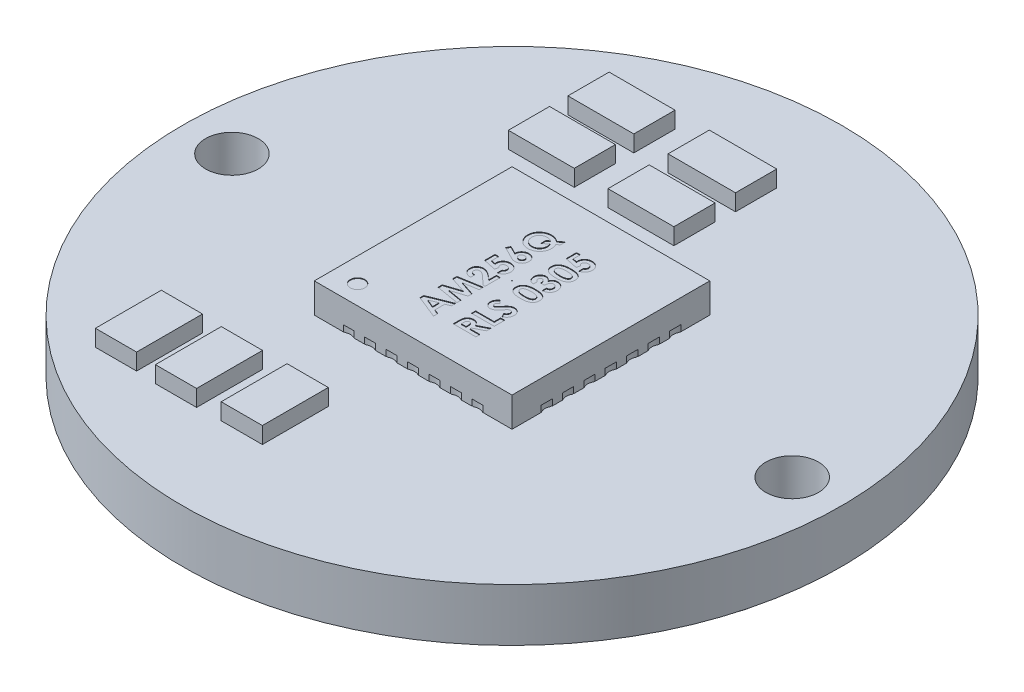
from build123d import *

# Parameters (mm, degrees)
SKETCH1_W           = 6
SKETCH1_H           = 6
SKETCH1_R           = 0.010623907
BASE_EXTRUDE_DEPTH  = 0.9
SKETCH2_W           = 4.4
SKETCH2_H           = 4.4
SKETCH2_R           = 0.005
SKETCH2_W_2         = 0.5
SKETCH2_H_2         = 0.3
SKETCH2_W_3         = 0.3
SKETCH2_H_3         = 0.5
SKETCH2_W_4         = 0.4
SKETCH2_H_4         = 0.4
BOSS_EXTRUDE1_DEPTH = 0.01
SKETCH3_R           = 0.3
CUT_EXTRUDE1_DEPTH  = 0.2
CUT_EXTRUDE2_DEPTH  = 0.02
SKETCH5_R           = 0.22
CUT_EXTRUDE3_DEPTH  = 0.02
SKETCH6_W           = 3
SKETCH6_H           = 3
CUT_EXTRUDE4_DEPTH  = 0.55
SKETCH7_W           = 4.4
SKETCH7_H           = 4.4
BOSS_EXTRUDE2_DEPTH = 0.3
SKETCH9_R           = 10
SKETCH9_R_2         = 0.8
BOSS_EXTRUDE3_DEPTH = 1.6
SKETCH11_R          = 0.8
SKETCH11_W          = 0.8
SKETCH11_H          = 2.5
BOSS_EXTRUDE5_DEPTH = 0.05
SKETCH12_W          = 2
SKETCH12_H          = 1.25
SKETCH12_W_2        = 2.04585674
SKETCH12_W_3        = 1.25
SKETCH12_H_2        = 2
BOSS_EXTRUDE6_DEPTH = 0.5
SKETCH13_W          = 1.25
SKETCH13_H          = 2
SKETCH13_W_2        = 2
SKETCH13_H_2        = 1.25
BOSS_EXTRUDE7_DEPTH = 0.5
SKETCH14_W          = 3
SKETCH14_H          = 1.5
BOSS_EXTRUDE8_DEPTH = 1.8
BOSS_EXTRUDE9_DEPTH = 1.6
SKETCH21_R          = 0.328315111
CUT_EXTRUDE9_DEPTH  = 0.01
SKETCH22_W          = 0.158417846
SKETCH22_H          = 1.779871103
CUT_EXTRUDE10_DEPTH = 0.01
CUT_EXTRUDE11_DEPTH = 8.6


with BuildPart() as part:
    # Sketch1 → Base-Extrude (new body)
    with BuildSketch(Plane(origin=(0, 0, 0), x_dir=(1, 0, 0), z_dir=(0, 1, 0))):
        with Locations((3, 3)):
            Rectangle(SKETCH1_W, SKETCH1_H)
        with Locations(Location((3, 3, 0), (0, 0, 270))):
            Circle(SKETCH1_R, mode=Mode.SUBTRACT)
    extrude(amount=BASE_EXTRUDE_DEPTH)

    # Sketch2 → Boss-Extrude1 (add)
    # profile 1 of 30: a face of its own
    with BuildSketch(Plane.XZ):
        with Locations((3.000818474, -3)):
            Rectangle(SKETCH2_W, SKETCH2_H)
        with Locations(Location((3, -3, 0), (0, 0, 270))):
            Circle(SKETCH2_R, mode=Mode.SUBTRACT)
    # profile 2 of 30: a face of its own
    with BuildSketch(Plane.XZ):
        with Locations((0.250818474, -3.65)):
            Rectangle(SKETCH2_W_2, SKETCH2_H_2)
    # profile 3 of 30: a face of its own
    with BuildSketch(Plane.XZ):
        with Locations((1.700818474, -5.75)):
            Rectangle(SKETCH2_W_3, SKETCH2_H_3)
    # profile 4 of 30: a face of its own
    with BuildSketch(Plane.XZ):
        with Locations((1.050818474, -5.75)):
            Rectangle(SKETCH2_W_3, SKETCH2_H_3)
    # profile 5 of 30: a face of its own
    with BuildSketch(Plane.XZ):
        with Locations((0.250818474, -4.95)):
            Rectangle(SKETCH2_W_2, SKETCH2_H_2)
    # profile 6 of 30: a face of its own
    with BuildSketch(Plane.XZ):
        with Locations((0.250818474, -4.3)):
            Rectangle(SKETCH2_W_2, SKETCH2_H_2)
    # profile 7 of 30: a face of its own
    with BuildSketch(Plane.XZ):
        with Locations((5.67, -0.316672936)):
            Rectangle(SKETCH2_W_4, SKETCH2_H_4)
    # profile 8 of 30: a face of its own
    with BuildSketch(Plane.XZ):
        with Locations((1.050818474, -0.25)):
            Rectangle(SKETCH2_W_3, SKETCH2_H_3)
    # profile 9 of 30: a face of its own
    with BuildSketch(Plane.XZ):
        with Locations((1.700818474, -0.25)):
            Rectangle(SKETCH2_W_3, SKETCH2_H_3)
    # profile 10 of 30: a face of its own
    with BuildSketch(Plane.XZ):
        with Locations((0.250818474, -1.05)):
            Rectangle(SKETCH2_W_2, SKETCH2_H_2)
    # profile 11 of 30: a face of its own
    with BuildSketch(Plane.XZ):
        with Locations((0.250818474, -1.7)):
            Rectangle(SKETCH2_W_2, SKETCH2_H_2)
    # profile 12 of 30: a face of its own
    with BuildSketch(Plane.XZ):
        with Locations((0.250818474, -2.35)):
            Rectangle(SKETCH2_W_2, SKETCH2_H_2)
    # profile 13 of 30: a face of its own
    with BuildSketch(Plane.XZ):
        with Locations((0.250818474, -3)):
            Rectangle(SKETCH2_W_2, SKETCH2_H_2)
    # profile 14 of 30: a face of its own
    with BuildSketch(Plane.XZ):
        with Locations((5.750818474, -3.65)):
            Rectangle(SKETCH2_W_2, SKETCH2_H_2)
    # profile 15 of 30: a face of its own
    with BuildSketch(Plane.XZ):
        with Locations((5.750818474, -4.3)):
            Rectangle(SKETCH2_W_2, SKETCH2_H_2)
    # profile 16 of 30: a face of its own
    with BuildSketch(Plane.XZ):
        with Locations((5.750818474, -4.95)):
            Rectangle(SKETCH2_W_2, SKETCH2_H_2)
    # profile 17 of 30: a face of its own
    with BuildSketch(Plane.XZ):
        with Locations((3.650818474, -5.75)):
            Rectangle(SKETCH2_W_3, SKETCH2_H_3)
    # profile 18 of 30: a face of its own
    with BuildSketch(Plane.XZ):
        with Locations((4.300818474, -5.75)):
            Rectangle(SKETCH2_W_3, SKETCH2_H_3)
    # profile 19 of 30: a face of its own
    with BuildSketch(Plane.XZ):
        with Locations((4.950818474, -5.75)):
            Rectangle(SKETCH2_W_3, SKETCH2_H_3)
    # profile 20 of 30: a face of its own
    with BuildSketch(Plane.XZ):
        with Locations((3.000818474, -5.75)):
            Rectangle(SKETCH2_W_3, SKETCH2_H_3)
    # profile 21 of 30: a face of its own
    with BuildSketch(Plane.XZ):
        with Locations((2.350818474, -5.75)):
            Rectangle(SKETCH2_W_3, SKETCH2_H_3)
    # profile 22 of 30: a face of its own
    with BuildSketch(Plane.XZ):
        with Locations((5.750818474, -1.05)):
            Rectangle(SKETCH2_W_2, SKETCH2_H_2)
    # profile 23 of 30: a face of its own
    with BuildSketch(Plane.XZ):
        with Locations((5.750818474, -3)):
            Rectangle(SKETCH2_W_2, SKETCH2_H_2)
    # profile 24 of 30: a face of its own
    with BuildSketch(Plane.XZ):
        with Locations((5.750818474, -2.35)):
            Rectangle(SKETCH2_W_2, SKETCH2_H_2)
    # profile 25 of 30: a face of its own
    with BuildSketch(Plane.XZ):
        with Locations((5.750818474, -1.7)):
            Rectangle(SKETCH2_W_2, SKETCH2_H_2)
    # profile 26 of 30: a face of its own
    with BuildSketch(Plane.XZ):
        with Locations((2.350818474, -0.25)):
            Rectangle(SKETCH2_W_3, SKETCH2_H_3)
    # profile 27 of 30: a face of its own
    with BuildSketch(Plane.XZ):
        with Locations((4.950818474, -0.25)):
            Rectangle(SKETCH2_W_3, SKETCH2_H_3)
    # profile 28 of 30: a face of its own
    with BuildSketch(Plane.XZ):
        with Locations((4.300818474, -0.25)):
            Rectangle(SKETCH2_W_3, SKETCH2_H_3)
    # profile 29 of 30: a face of its own
    with BuildSketch(Plane.XZ):
        with Locations((3.650818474, -0.25)):
            Rectangle(SKETCH2_W_3, SKETCH2_H_3)
    # profile 30 of 30: a face of its own
    with BuildSketch(Plane.XZ):
        with Locations((3.000818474, -0.25)):
            Rectangle(SKETCH2_W_3, SKETCH2_H_3)
    extrude(amount=BOSS_EXTRUDE1_DEPTH)

    # Sketch3 → Cut-Extrude1 (cut)
    with BuildSketch(Plane.XZ.offset(0.01)):
        with Locations((4.945893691, 0.25)):
            Circle(SKETCH3_R)
        with Locations((4.295893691, 0.25)):
            Circle(SKETCH3_R)
        with Locations((3.645893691, 0.25)):
            Circle(SKETCH3_R)
        with Locations((2.995893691, 0.25)):
            Circle(SKETCH3_R)
        with Locations((2.345893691, 0.25)):
            Circle(SKETCH3_R)
        with Locations((1.695893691, 0.25)):
            Circle(SKETCH3_R)
        with Locations((1.045893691, 0.25)):
            Circle(SKETCH3_R)
        with Locations((4.945893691, -6.25)):
            Circle(SKETCH3_R)
        with Locations((4.295893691, -6.25)):
            Circle(SKETCH3_R)
        with Locations((3.645893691, -6.25)):
            Circle(SKETCH3_R)
        with Locations((2.995893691, -6.25)):
            Circle(SKETCH3_R)
        with Locations((2.345893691, -6.25)):
            Circle(SKETCH3_R)
        with Locations((1.695893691, -6.25)):
            Circle(SKETCH3_R)
        with Locations((1.045893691, -6.25)):
            Circle(SKETCH3_R)
        with Locations((-0.254106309, -1.05)):
            Circle(SKETCH3_R)
        with Locations((6.245893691, -1.7)):
            Circle(SKETCH3_R)
        with Locations((6.245893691, -1.05)):
            Circle(SKETCH3_R)
        with Locations((-0.254106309, -1.7)):
            Circle(SKETCH3_R)
        with Locations((6.245893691, -2.35)):
            Circle(SKETCH3_R)
        with Locations((-0.254106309, -2.35)):
            Circle(SKETCH3_R)
        with Locations((6.245893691, -3)):
            Circle(SKETCH3_R)
        with Locations((-0.254106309, -3)):
            Circle(SKETCH3_R)
        with Locations((6.245893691, -3.65)):
            Circle(SKETCH3_R)
        with Locations((-0.254106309, -3.65)):
            Circle(SKETCH3_R)
        with Locations((6.245893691, -4.3)):
            Circle(SKETCH3_R)
        with Locations((-0.254106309, -4.3)):
            Circle(SKETCH3_R)
        with Locations((6.245893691, -4.95)):
            Circle(SKETCH3_R)
        with Locations((-0.254106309, -4.95)):
            Circle(SKETCH3_R)
    extrude(amount=-CUT_EXTRUDE1_DEPTH, mode=Mode.SUBTRACT)

    # Sketch4 → Cut-Extrude2 (cut)
    # profile 1 of 13: a face of its own
    with BuildSketch(Plane(origin=(0, 0.9, 0), x_dir=(-1, 0, 0), z_dir=(0, 1, 0))):
        Polygon((-2.045639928, -1.161083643), (-2.045639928, -1.275598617), (-2.733556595, -1.553411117), (-2.733556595, -1.421532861), (-2.592445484, -1.368064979), (-2.592445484, -1.068341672), (-2.733556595, -1.01487379), (-2.733556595, -0.883133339), align=None)
        Polygon((-2.230159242, -1.218272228), (-2.468973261, -1.115194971), (-2.468973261, -1.321349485), align=None, mode=Mode.SUBTRACT)
    # profile 2 of 13: a face of its own
    with BuildSketch(Plane(origin=(0, 0.9, 0), x_dir=(-1, 0, 0), z_dir=(0, 1, 0))):
        Polygon((-2.045639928, -1.709267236), (-2.045639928, -1.837424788), (-2.525472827, -1.994383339), (-2.045639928, -2.15244432), (-2.045639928, -2.279361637), (-2.733556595, -2.395668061), (-2.733556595, -2.270679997), (-2.299061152, -2.197230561), (-2.733556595, -2.054190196), (-2.733556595, -1.933749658), (-2.299061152, -1.791536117), (-2.733556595, -1.718224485), (-2.733556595, -1.593098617), align=None)
    # profile 3 of 13: a face of its own
    with BuildSketch(Plane(origin=(0, 0.9, 0), x_dir=(-1, 0, 0), z_dir=(0, 1, 0))):
        with BuildLine():
            Line((-2.274945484, -2.589695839), (-2.274945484, -2.466223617))
            add(Edge.make_bspline(
                [(-2.274945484, -2.466223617), (-2.265605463, -2.466756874), (-2.247355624, -2.467798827), (-2.220847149, -2.471943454), (-2.195799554, -2.477497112), (-2.17230046, -2.484909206), (-2.150358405, -2.494222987), (-2.129898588, -2.505198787), (-2.111028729, -2.518117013), (-2.093839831, -2.532702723), (-2.078419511, -2.548708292), (-2.064746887, -2.565801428), (-2.053464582, -2.584243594), (-2.044180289, -2.603697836), (-2.036762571, -2.624160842), (-2.031803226, -2.645826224), (-2.028444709, -2.668506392), (-2.028150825, -2.684032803), (-2.028001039, -2.691946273)],
                knots=[0, 0, 0, 0, 1.199038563, 2.342849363, 3.436047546, 4.486744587, 5.497670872, 6.488682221, 7.459191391, 8.424610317, 9.374430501, 10.305433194, 11.225809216, 12.140057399, 13.06607119, 14.010487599, 14.985989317, 16, 16, 16, 16], degree=3))
            add(Edge.make_bspline(
                [(-2.028001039, -2.691946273), (-2.028304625, -2.701659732), (-2.028897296, -2.72062268), (-2.033937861, -2.748180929), (-2.042418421, -2.773942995), (-2.054149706, -2.797909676), (-2.069122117, -2.819793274), (-2.087130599, -2.839451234), (-2.108112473, -2.856760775), (-2.131639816, -2.871390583), (-2.156591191, -2.883347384), (-2.182286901, -2.891898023), (-2.208191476, -2.897481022), (-2.225630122, -2.89807922), (-2.234293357, -2.898376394)],
                knots=[0, 0, 0, 0, 1.075208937, 2.099059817, 3.090102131, 4.070747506, 5.044426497, 6.016695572, 7.013986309, 8.047248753, 9.078128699, 10.07077592, 11.041593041, 12, 12, 12, 12], degree=3))
            add(Edge.make_bspline(
                [(-2.234293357, -2.898376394), (-2.239533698, -2.898260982), (-2.250081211, -2.898028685), (-2.266042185, -2.896413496), (-2.282300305, -2.893990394), (-2.298841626, -2.890336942), (-2.315670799, -2.885780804), (-2.332838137, -2.88025349), (-2.350246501, -2.87362707), (-2.368091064, -2.866011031), (-2.386432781, -2.856928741), (-2.405534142, -2.846338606), (-2.425451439, -2.834021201), (-2.446039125, -2.81984281), (-2.467743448, -2.804378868), (-2.490005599, -2.78689597), (-2.513190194, -2.767905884), (-2.528677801, -2.754413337), (-2.536634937, -2.747481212)],
                knots=[0, 0, 0, 0, 0.728291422, 1.465870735, 2.227967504, 3.011895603, 3.818808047, 4.650669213, 5.517493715, 6.406970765, 7.346374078, 8.360901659, 9.441709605, 10.599840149, 11.834858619, 13.145178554, 14.533265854, 16, 16, 16, 16], degree=3))
            Line((-2.536634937, -2.747481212), (-2.618903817, -2.675685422))
            Line((-2.618903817, -2.675685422), (-2.618903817, -2.907195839))
            Line((-2.618903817, -2.907195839), (-2.733556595, -2.907195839))
            Line((-2.733556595, -2.907195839), (-2.733556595, -2.448584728))
            Line((-2.733556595, -2.448584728), (-2.670993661, -2.448584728))
            Line((-2.670993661, -2.448584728), (-2.454228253, -2.652258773))
            add(Edge.make_bspline(
                [(-2.454228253, -2.652258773), (-2.447905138, -2.65815566), (-2.435659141, -2.669576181), (-2.417674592, -2.685826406), (-2.400607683, -2.700531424), (-2.384276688, -2.713386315), (-2.369211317, -2.725065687), (-2.354957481, -2.735048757), (-2.34164404, -2.743426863), (-2.325590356, -2.752522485), (-2.30644348, -2.761160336), (-2.284385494, -2.769086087), (-2.26330314, -2.773917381), (-2.249565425, -2.774584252), (-2.242974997, -2.774904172)],
                knots=[0, 0, 0, 0, 1.246127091, 2.413378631, 3.493388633, 4.492180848, 5.408488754, 6.240484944, 6.999099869, 7.674939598, 8.898438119, 10.020720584, 11.050475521, 12, 12, 12, 12], degree=3))
            add(Edge.make_bspline(
                [(-2.242974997, -2.774904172), (-2.236597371, -2.774668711), (-2.224239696, -2.774212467), (-2.206712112, -2.769073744), (-2.190722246, -2.761384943), (-2.176998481, -2.750222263), (-2.165622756, -2.736749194), (-2.157286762, -2.721091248), (-2.152387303, -2.703535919), (-2.151783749, -2.691242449), (-2.151473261, -2.684918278)],
                knots=[0, 0, 0, 0, 1.061596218, 2.057012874, 3.024113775, 4.006148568, 4.986025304, 5.949989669, 6.945406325, 8, 8, 8, 8], degree=3))
            add(Edge.make_bspline(
                [(-2.151473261, -2.684918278), (-2.151588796, -2.681651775), (-2.151816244, -2.67522114), (-2.153330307, -2.665768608), (-2.155998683, -2.656773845), (-2.159573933, -2.648136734), (-2.164312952, -2.639949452), (-2.170154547, -2.632232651), (-2.176950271, -2.624905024), (-2.184678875, -2.618000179), (-2.193303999, -2.611715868), (-2.20274687, -2.606134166), (-2.213001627, -2.601519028), (-2.223932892, -2.597455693), (-2.235658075, -2.594321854), (-2.248107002, -2.592040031), (-2.26125942, -2.590305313), (-2.270300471, -2.589902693), (-2.274945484, -2.589695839)],
                knots=[0, 0, 0, 0, 0.903469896, 1.778625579, 2.63899355, 3.493148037, 4.358286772, 5.247621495, 6.164656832, 7.118446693, 8.109501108, 9.111810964, 10.146451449, 11.215617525, 12.33435995, 13.498009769, 14.714554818, 16, 16, 16, 16], degree=3))
        make_face()
    # profile 4 of 13: a face of its own
    with BuildSketch(Plane(origin=(0, 0.9, 0), x_dir=(-1, 0, 0), z_dir=(0, 1, 0))):
        with BuildLine():
            Line((-2.045639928, -3.123134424), (-2.045639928, -3.436362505))
            Line((-2.045639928, -3.436362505), (-2.160292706, -3.436362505))
            Line((-2.160292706, -3.436362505), (-2.160292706, -3.220975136))
            Line((-2.160292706, -3.220975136), (-2.290379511, -3.194103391))
            add(Edge.make_bspline(
                [(-2.290379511, -3.194103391), (-2.289356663, -3.197764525), (-2.287327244, -3.20502853), (-2.285359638, -3.21591626), (-2.284014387, -3.226453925), (-2.283846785, -3.233327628), (-2.283764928, -3.236684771)],
                knots=[0, 0, 0, 0, 1.054652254, 2.092520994, 3.068380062, 4, 4, 4, 4], degree=3))
            add(Edge.make_bspline(
                [(-2.283764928, -3.236684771), (-2.283932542, -3.243999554), (-2.284262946, -3.258418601), (-2.287399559, -3.279511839), (-2.292339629, -3.29970986), (-2.299385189, -3.318950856), (-2.308555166, -3.337216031), (-2.319648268, -3.354527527), (-2.332683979, -3.370906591), (-2.347670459, -3.38606226), (-2.364125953, -3.399987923), (-2.381924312, -3.412095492), (-2.400811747, -3.422436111), (-2.420905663, -3.430660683), (-2.442079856, -3.437152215), (-2.464347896, -3.441843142), (-2.487736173, -3.444617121), (-2.503692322, -3.444991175), (-2.511830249, -3.44518195)],
                knots=[0, 0, 0, 0, 1.01440847, 1.999622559, 2.951875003, 3.895578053, 4.836219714, 5.782137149, 6.743708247, 7.735272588, 8.734977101, 9.730283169, 10.717124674, 11.717316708, 12.737475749, 13.78628267, 14.87096371, 16, 16, 16, 16], degree=3))
            add(Edge.make_bspline(
                [(-2.511830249, -3.44518195), (-2.520061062, -3.444950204), (-2.536302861, -3.444492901), (-2.560175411, -3.441471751), (-2.583087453, -3.436243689), (-2.604911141, -3.428701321), (-2.625832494, -3.419372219), (-2.645709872, -3.407783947), (-2.664600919, -3.394136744), (-2.682247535, -3.378462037), (-2.698379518, -3.361428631), (-2.712570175, -3.343290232), (-2.724511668, -3.32417647), (-2.73416237, -3.304086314), (-2.741797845, -3.283135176), (-2.747356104, -3.261316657), (-2.750543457, -3.238524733), (-2.750975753, -3.223051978), (-2.751195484, -3.215187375)],
                knots=[0, 0, 0, 0, 1.06812338, 2.107719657, 3.117068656, 4.112431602, 5.099639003, 6.085279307, 7.092884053, 8.119131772, 9.143854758, 10.133578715, 11.102895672, 12.062725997, 13.020721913, 13.992309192, 14.979516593, 16, 16, 16, 16], degree=3))
            add(Edge.make_bspline(
                [(-2.751195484, -3.215187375), (-2.75101573, -3.208154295), (-2.750661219, -3.19428359), (-2.748482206, -3.17385265), (-2.744629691, -3.154154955), (-2.739054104, -3.135295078), (-2.732191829, -3.117074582), (-2.723609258, -3.099704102), (-2.713469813, -3.083088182), (-2.701958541, -3.067274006), (-2.688991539, -3.052518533), (-2.674796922, -3.0390513), (-2.659553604, -3.026790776), (-2.643073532, -3.015999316), (-2.625381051, -3.006710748), (-2.606684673, -2.998473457), (-2.586789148, -2.991731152), (-2.572996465, -2.988309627), (-2.56598715, -2.986570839)],
                knots=[0, 0, 0, 0, 1.054957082, 2.080596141, 3.077793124, 4.061112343, 5.027190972, 5.994718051, 6.962465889, 7.943658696, 8.924948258, 9.904494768, 10.875059, 11.855380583, 12.854004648, 13.869083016, 14.917087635, 16, 16, 16, 16], degree=3))
            Line((-2.56598715, -2.986570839), (-2.56598715, -3.12768195))
            add(Edge.make_bspline(
                [(-2.56598715, -3.12768195), (-2.570844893, -3.130261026), (-2.580285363, -3.135273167), (-2.592809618, -3.144815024), (-2.603551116, -3.155494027), (-2.61241078, -3.16732459), (-2.619122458, -3.180138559), (-2.624259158, -3.193506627), (-2.627166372, -3.207666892), (-2.627536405, -3.21733384), (-2.627723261, -3.22221537)],
                knots=[0, 0, 0, 0, 1.105084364, 2.147605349, 3.154024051, 4.144789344, 5.108147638, 6.055727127, 7.018198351, 8, 8, 8, 8], degree=3))
            add(Edge.make_bspline(
                [(-2.627723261, -3.22221537), (-2.627595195, -3.225618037), (-2.627343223, -3.232312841), (-2.62601124, -3.242177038), (-2.623485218, -3.251591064), (-2.619998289, -3.260633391), (-2.615591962, -3.269330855), (-2.610178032, -3.277639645), (-2.603790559, -3.285518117), (-2.596532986, -3.292940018), (-2.588421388, -3.299639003), (-2.579762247, -3.30556464), (-2.570563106, -3.310633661), (-2.560722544, -3.314573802), (-2.550349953, -3.317753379), (-2.539432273, -3.320108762), (-2.527944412, -3.321513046), (-2.520102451, -3.321643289), (-2.516102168, -3.321709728)],
                knots=[0, 0, 0, 0, 0.978584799, 1.925382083, 2.854237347, 3.773848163, 4.706917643, 5.651871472, 6.619075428, 7.618203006, 8.630937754, 9.638147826, 10.630884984, 11.643619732, 12.679505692, 13.746568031, 14.850495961, 16, 16, 16, 16], degree=3))
            add(Edge.make_bspline(
                [(-2.516102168, -3.321709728), (-2.512191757, -3.321653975), (-2.504574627, -3.321545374), (-2.493450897, -3.320009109), (-2.48280204, -3.318084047), (-2.472727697, -3.314972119), (-2.463115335, -3.311175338), (-2.454187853, -3.306211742), (-2.445536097, -3.300823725), (-2.437787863, -3.294261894), (-2.430619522, -3.28732624), (-2.424361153, -3.279854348), (-2.41916443, -3.27193814), (-2.414628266, -3.263817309), (-2.41132678, -3.255169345), (-2.40905321, -3.24618828), (-2.407384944, -3.236883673), (-2.407286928, -3.230537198), (-2.40723715, -3.227314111)],
                knots=[0, 0, 0, 0, 1.166407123, 2.272056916, 3.347877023, 4.393466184, 5.414668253, 6.42708463, 7.438943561, 8.452102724, 9.450960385, 10.414941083, 11.35441816, 12.274885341, 13.186627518, 14.108013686, 15.039145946, 16, 16, 16, 16], degree=3))
            add(Edge.make_bspline(
                [(-2.40723715, -3.227314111), (-2.407369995, -3.22381309), (-2.407636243, -3.216796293), (-2.409802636, -3.206371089), (-2.413308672, -3.196071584), (-2.418145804, -3.185840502), (-2.424476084, -3.175779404), (-2.431900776, -3.165622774), (-2.440959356, -3.155710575), (-2.447706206, -3.149408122), (-2.451196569, -3.146147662)],
                knots=[0, 0, 0, 0, 0.88288272, 1.769486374, 2.674910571, 3.623812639, 4.617874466, 5.670434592, 6.794841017, 8, 8, 8, 8], degree=3))
            Line((-2.451196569, -3.146147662), (-2.427356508, -3.042243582))
            Line((-2.427356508, -3.042243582), (-2.045639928, -3.123134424))
        make_face()
    # profile 5 of 13: a face of its own
    with BuildSketch(Plane(origin=(0, 0.9, 0), x_dir=(-1, 0, 0), z_dir=(0, 1, 0))):
        with BuildLine():
            Line((-2.028001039, -3.777564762), (-2.083398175, -3.886843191))
            Line((-2.083398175, -3.886843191), (-2.319042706, -3.766953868))
            add(Edge.make_bspline(
                [(-2.319042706, -3.766953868), (-2.319226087, -3.774036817), (-2.319587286, -3.787987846), (-2.322506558, -3.808513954), (-2.32755328, -3.828137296), (-2.334242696, -3.847055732), (-2.343226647, -3.865038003), (-2.353913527, -3.882373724), (-2.366947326, -3.898614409), (-2.381388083, -3.914132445), (-2.397386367, -3.928242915), (-2.414577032, -3.940500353), (-2.432541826, -3.951182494), (-2.451682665, -3.95948636), (-2.471682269, -3.966184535), (-2.492620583, -3.971017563), (-2.514558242, -3.973774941), (-2.529461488, -3.974155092), (-2.537048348, -3.974348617)],
                knots=[0, 0, 0, 0, 1.013260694, 1.995783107, 2.958651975, 3.908806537, 4.861209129, 5.829647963, 6.817170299, 7.835534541, 8.860094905, 9.863329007, 10.853101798, 11.844815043, 12.84250023, 13.867713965, 14.914507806, 16, 16, 16, 16], degree=3))
            add(Edge.make_bspline(
                [(-2.537048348, -3.974348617), (-2.544361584, -3.974167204), (-2.558816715, -3.97380863), (-2.580048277, -3.970846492), (-2.600416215, -3.966054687), (-2.619891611, -3.959223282), (-2.638504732, -3.95048851), (-2.656432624, -3.940038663), (-2.673279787, -3.927339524), (-2.689131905, -3.912980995), (-2.70363508, -3.897269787), (-2.716386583, -3.880600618), (-2.727045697, -3.863050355), (-2.735997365, -3.84484426), (-2.742685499, -3.825653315), (-2.747731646, -3.805754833), (-2.750643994, -3.785000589), (-2.751010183, -3.77091304), (-2.751195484, -3.76378438)],
                knots=[0, 0, 0, 0, 1.049811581, 2.075027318, 3.071773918, 4.050170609, 5.032849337, 6.020452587, 7.024397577, 8.056465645, 9.088112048, 10.090756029, 11.064784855, 12.032427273, 12.998382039, 13.977467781, 14.976547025, 16, 16, 16, 16], degree=3))
            add(Edge.make_bspline(
                [(-2.751195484, -3.76378438), (-2.751043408, -3.756329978), (-2.750744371, -3.741671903), (-2.747395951, -3.720223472), (-2.742355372, -3.69965258), (-2.735158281, -3.68007484), (-2.725994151, -3.661368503), (-2.714654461, -3.643753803), (-2.701264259, -3.62708236), (-2.686124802, -3.611531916), (-2.669541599, -3.597522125), (-2.652323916, -3.585026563), (-2.634444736, -3.574455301), (-2.615923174, -3.56589811), (-2.596818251, -3.559221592), (-2.577093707, -3.554576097), (-2.556801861, -3.551549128), (-2.543030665, -3.551194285), (-2.536083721, -3.551015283)],
                knots=[0, 0, 0, 0, 1.063775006, 2.091769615, 3.092589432, 4.084662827, 5.064601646, 6.061867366, 7.070035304, 8.113879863, 9.156342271, 10.166834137, 11.149076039, 12.117706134, 13.076241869, 14.034148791, 15.008317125, 16, 16, 16, 16], degree=3))
            add(Edge.make_bspline(
                [(-2.536083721, -3.551015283), (-2.530704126, -3.551109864), (-2.51991499, -3.551299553), (-2.503758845, -3.553205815), (-2.487560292, -3.556104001), (-2.473891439, -3.559463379), (-2.462332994, -3.562922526), (-2.452551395, -3.566404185), (-2.441695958, -3.570718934), (-2.429738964, -3.575651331), (-2.416694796, -3.581356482), (-2.40259901, -3.587804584), (-2.387344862, -3.595011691), (-2.376867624, -3.600151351), (-2.371408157, -3.602829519)],
                knots=[0, 0, 0, 0, 1.110454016, 2.227089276, 3.35462975, 4.507227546, 5.131400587, 5.845402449, 6.650387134, 7.543487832, 8.516250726, 9.590168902, 10.744287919, 12, 12, 12, 12], degree=3))
            Line((-2.371408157, -3.602829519), (-2.028001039, -3.777564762))
        make_face()
        with BuildLine():
            add(Edge.make_bspline(
                [(-2.433695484, -3.761028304), (-2.433967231, -3.755103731), (-2.434499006, -3.743510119), (-2.440068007, -3.727025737), (-2.448804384, -3.711995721), (-2.460971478, -3.698967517), (-2.475511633, -3.688070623), (-2.492096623, -3.680063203), (-2.510505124, -3.675246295), (-2.523376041, -3.674745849), (-2.530020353, -3.674487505)],
                knots=[0, 0, 0, 0, 0.981744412, 1.921144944, 2.858899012, 3.85339082, 4.86292663, 5.863643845, 6.897155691, 8, 8, 8, 8], degree=3))
            add(Edge.make_bspline(
                [(-2.530020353, -3.674487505), (-2.536665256, -3.674796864), (-2.549590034, -3.675398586), (-2.568216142, -3.680353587), (-2.585109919, -3.688731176), (-2.599826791, -3.700174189), (-2.612143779, -3.713529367), (-2.621140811, -3.728464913), (-2.626704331, -3.744616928), (-2.627381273, -3.755794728), (-2.627723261, -3.761441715)],
                knots=[0, 0, 0, 0, 1.098593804, 2.136838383, 3.163662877, 4.199231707, 5.205701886, 6.153612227, 7.067210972, 8, 8, 8, 8], degree=3))
            add(Edge.make_bspline(
                [(-2.627723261, -3.761441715), (-2.627374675, -3.767405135), (-2.626691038, -3.779100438), (-2.621368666, -3.795971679), (-2.61247596, -3.811383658), (-2.600285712, -3.825010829), (-2.585720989, -3.836716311), (-2.568659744, -3.844815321), (-2.54994183, -3.850044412), (-2.536809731, -3.850592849), (-2.530020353, -3.850876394)],
                knots=[0, 0, 0, 0, 0.96921794, 1.900804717, 2.848419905, 3.844199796, 4.861108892, 5.867439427, 6.897452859, 8, 8, 8, 8], degree=3))
            add(Edge.make_bspline(
                [(-2.530020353, -3.850876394), (-2.523373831, -3.85057297), (-2.510490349, -3.849984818), (-2.492088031, -3.84501634), (-2.475462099, -3.83688269), (-2.460924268, -3.825679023), (-2.448697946, -3.812205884), (-2.440068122, -3.796510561), (-2.4344832, -3.779316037), (-2.433962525, -3.767227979), (-2.433695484, -3.761028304)],
                knots=[0, 0, 0, 0, 1.083506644, 2.10024676, 3.086160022, 4.086481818, 5.079696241, 6.033050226, 6.991198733, 8, 8, 8, 8], degree=3))
        make_face(mode=Mode.SUBTRACT)
    # profile 6 of 13: a face of its own
    with BuildSketch(Plane(origin=(0, 0.9, 0), x_dir=(-1, 0, 0), z_dir=(0, 1, 0))):
        with BuildLine():
            Line((-2.635578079, -4.71518195), (-2.786473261, -4.831901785))
            Line((-2.786473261, -4.831901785), (-2.786473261, -4.678250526))
            Line((-2.786473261, -4.678250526), (-2.708338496, -4.61775465))
            add(Edge.make_bspline(
                [(-2.708338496, -4.61775465), (-2.711788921, -4.61141789), (-2.718673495, -4.598774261), (-2.727258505, -4.578947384), (-2.734789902, -4.558753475), (-2.740691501, -4.537899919), (-2.745336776, -4.516586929), (-2.74888352, -4.494704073), (-2.750753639, -4.472267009), (-2.751047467, -4.457124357), (-2.751195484, -4.449496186)],
                knots=[0, 0, 0, 0, 0.985706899, 1.966764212, 2.949968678, 3.929638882, 4.925906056, 5.930211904, 6.957336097, 8, 8, 8, 8], degree=3))
            add(Edge.make_bspline(
                [(-2.751195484, -4.449496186), (-2.750910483, -4.436798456), (-2.75035149, -4.411893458), (-2.744984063, -4.375419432), (-2.736880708, -4.340502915), (-2.72504129, -4.307273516), (-2.70999603, -4.275619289), (-2.691351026, -4.245793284), (-2.66962322, -4.217448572), (-2.644599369, -4.191278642), (-2.617481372, -4.167333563), (-2.588670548, -4.14641129), (-2.558616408, -4.128625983), (-2.527271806, -4.114121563), (-2.494582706, -4.102842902), (-2.46063839, -4.094944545), (-2.42539195, -4.089937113), (-2.401466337, -4.089316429), (-2.389322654, -4.089001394)],
                knots=[0, 0, 0, 0, 1.070144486, 2.098953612, 3.10240755, 4.088674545, 5.067611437, 6.052256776, 7.0494179, 8.074208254, 9.100739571, 10.09639475, 11.072322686, 12.041159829, 13.004031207, 13.983083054, 14.976293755, 16, 16, 16, 16], degree=3))
            add(Edge.make_bspline(
                [(-2.389322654, -4.089001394), (-2.381186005, -4.089107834), (-2.365015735, -4.089319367), (-2.341045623, -4.091808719), (-2.317579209, -4.095506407), (-2.294608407, -4.100538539), (-2.272214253, -4.107376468), (-2.250316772, -4.115648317), (-2.228858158, -4.12533721), (-2.207969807, -4.136423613), (-2.187969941, -4.149024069), (-2.168696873, -4.162411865), (-2.150770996, -4.177304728), (-2.133785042, -4.193172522), (-2.117762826, -4.210076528), (-2.102963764, -4.228278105), (-2.089229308, -4.247533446), (-2.076550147, -4.267769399), (-2.065202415, -4.288719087), (-2.05516996, -4.310176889), (-2.046827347, -4.332074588), (-2.039822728, -4.354318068), (-2.034682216, -4.377016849), (-2.030733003, -4.400002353), (-2.028542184, -4.423454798), (-2.028182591, -4.439202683), (-2.028001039, -4.447153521)],
                knots=[0, 0, 0, 0, 1.035868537, 2.058620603, 3.065590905, 4.060526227, 5.050634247, 6.044812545, 7.039747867, 8.04732973, 9.05375611, 10.048691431, 11.033670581, 12.018736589, 13.007807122, 13.997310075, 15.003787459, 16.018274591, 17.036549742, 18.036357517, 19.032616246, 20.018845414, 21.003668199, 21.994260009, 22.987336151, 24, 24, 24, 24], degree=3))
            add(Edge.make_bspline(
                [(-2.028001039, -4.447153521), (-2.028306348, -4.459160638), (-2.028907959, -4.482820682), (-2.03405259, -4.517624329), (-2.042247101, -4.551187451), (-2.054089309, -4.583369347), (-2.069010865, -4.614375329), (-2.087530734, -4.643894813), (-2.109082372, -4.672329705), (-2.133884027, -4.698894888), (-2.160943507, -4.723253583), (-2.189689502, -4.744802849), (-2.220002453, -4.762912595), (-2.251784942, -4.777814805), (-2.28507059, -4.789228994), (-2.319789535, -4.797333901), (-2.355912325, -4.802476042), (-2.380531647, -4.803073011), (-2.393043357, -4.803376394)],
                knots=[0, 0, 0, 0, 1.015478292, 2.001001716, 2.970040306, 3.933999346, 4.897009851, 5.876290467, 6.877507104, 7.911566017, 8.946369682, 9.954562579, 10.946388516, 11.928787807, 12.919455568, 13.917801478, 14.94181223, 16, 16, 16, 16], degree=3))
            add(Edge.make_bspline(
                [(-2.393043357, -4.803376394), (-2.40458627, -4.803123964), (-2.427288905, -4.802627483), (-2.460757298, -4.798326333), (-2.493016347, -4.791537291), (-2.524088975, -4.781786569), (-2.553941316, -4.769429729), (-2.582484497, -4.754033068), (-2.610057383, -4.736278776), (-2.62702877, -4.722249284), (-2.635578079, -4.71518195)],
                knots=[0, 0, 0, 0, 1.049646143, 2.064447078, 3.064298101, 4.044929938, 5.022708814, 5.998521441, 6.991758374, 8, 8, 8, 8], degree=3))
        make_face()
        with BuildLine():
            add(Edge.make_bspline(
                [(-2.530571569, -4.634153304), (-2.525302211, -4.637828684), (-2.514884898, -4.645094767), (-2.498361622, -4.654288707), (-2.481516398, -4.662186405), (-2.46426083, -4.668717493), (-2.446496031, -4.673685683), (-2.428337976, -4.677216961), (-2.409778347, -4.679555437), (-2.397276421, -4.679787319), (-2.3909763, -4.679904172)],
                knots=[0, 0, 0, 0, 1.031533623, 2.039301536, 3.033003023, 4.018477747, 4.999688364, 5.992485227, 6.988348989, 8, 8, 8, 8], degree=3))
            add(Edge.make_bspline(
                [(-2.3909763, -4.679904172), (-2.382789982, -4.67968669), (-2.366676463, -4.67925861), (-2.342989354, -4.676043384), (-2.320288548, -4.670657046), (-2.298518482, -4.663146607), (-2.277623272, -4.653688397), (-2.257776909, -4.641806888), (-2.238876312, -4.627847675), (-2.221103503, -4.61194551), (-2.204837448, -4.594632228), (-2.190511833, -4.576219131), (-2.178426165, -4.556832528), (-2.168667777, -4.536461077), (-2.160808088, -4.515325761), (-2.155532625, -4.493199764), (-2.152073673, -4.470275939), (-2.151675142, -4.454653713), (-2.151473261, -4.44674011)],
                knots=[0, 0, 0, 0, 1.056263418, 2.079093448, 3.078410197, 4.062632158, 5.04680056, 6.032966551, 7.041959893, 8.074807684, 9.106532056, 10.103754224, 11.080880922, 12.048629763, 13.014470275, 13.984975, 14.979267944, 16, 16, 16, 16], degree=3))
            add(Edge.make_bspline(
                [(-2.151473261, -4.44674011), (-2.151686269, -4.438598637), (-2.152105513, -4.422574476), (-2.155382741, -4.399049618), (-2.160523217, -4.376484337), (-2.168070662, -4.354997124), (-2.177580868, -4.334523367), (-2.189249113, -4.315062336), (-2.203145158, -4.296717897), (-2.218845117, -4.279422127), (-2.236338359, -4.263847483), (-2.254892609, -4.249851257), (-2.274940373, -4.238532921), (-2.295824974, -4.228801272), (-2.318073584, -4.221612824), (-2.341325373, -4.216139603), (-2.365818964, -4.213158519), (-2.38247105, -4.21270517), (-2.3909763, -4.212473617)],
                knots=[0, 0, 0, 0, 1.042541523, 2.051944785, 3.036764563, 4.002557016, 4.96338965, 5.924060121, 6.903168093, 7.906930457, 8.911106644, 9.899645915, 10.877621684, 11.854481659, 12.84623786, 13.866778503, 14.910431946, 16, 16, 16, 16], degree=3))
            add(Edge.make_bspline(
                [(-2.3909763, -4.212473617), (-2.400405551, -4.212752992), (-2.418885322, -4.213300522), (-2.445842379, -4.217154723), (-2.471303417, -4.223744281), (-2.495130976, -4.233275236), (-2.517660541, -4.245052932), (-2.538412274, -4.259890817), (-2.557796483, -4.27714455), (-2.569079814, -4.290463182), (-2.574806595, -4.297222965)],
                knots=[0, 0, 0, 0, 1.078047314, 2.112794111, 3.106520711, 4.077995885, 5.041371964, 6.006121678, 6.988020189, 8, 8, 8, 8], degree=3))
            add(Edge.make_bspline(
                [(-2.574806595, -4.297222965), (-2.579045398, -4.302753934), (-2.587451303, -4.313722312), (-2.598099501, -4.331289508), (-2.607298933, -4.349269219), (-2.614789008, -4.367848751), (-2.620577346, -4.387040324), (-2.624683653, -4.406775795), (-2.627268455, -4.427057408), (-2.627570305, -4.440760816), (-2.627723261, -4.447704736)],
                knots=[0, 0, 0, 0, 1.027432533, 2.037485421, 3.025540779, 4.00463061, 4.988703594, 5.97891808, 6.97585834, 8, 8, 8, 8], degree=3))
            add(Edge.make_bspline(
                [(-2.627723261, -4.447704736), (-2.627469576, -4.455671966), (-2.626966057, -4.47148545), (-2.62257996, -4.494761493), (-2.616020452, -4.517439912), (-2.609315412, -4.531657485), (-2.605950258, -4.538793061)],
                knots=[0, 0, 0, 0, 1.010952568, 2.006554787, 2.999521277, 4, 4, 4, 4], degree=3))
            Line((-2.605950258, -4.538793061), (-2.451334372, -4.41931715))
            Line((-2.451334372, -4.41931715), (-2.451334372, -4.572968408))
            Line((-2.451334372, -4.572968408), (-2.530571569, -4.634153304))
        make_face(mode=Mode.SUBTRACT)
    # profile 7 of 13: a face of its own
    with BuildSketch(Plane(origin=(0, 0.9, 0), x_dir=(-1, 0, 0), z_dir=(0, 1, 0))):
        with BuildLine():
            Line((-3.236264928, -0.980147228), (-3.236264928, -1.124014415))
            add(Edge.make_bspline(
                [(-3.236264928, -1.124014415), (-3.236298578, -1.133524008), (-3.236363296, -1.151813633), (-3.237388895, -1.17818603), (-3.238809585, -1.202413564), (-3.24100415, -1.224573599), (-3.243841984, -1.244578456), (-3.247284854, -1.262470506), (-3.25117436, -1.278260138), (-3.255941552, -1.292160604), (-3.261431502, -1.304670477), (-3.267628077, -1.316298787), (-3.274765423, -1.327250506), (-3.282554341, -1.337726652), (-3.2912738, -1.347540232), (-3.30085314, -1.356664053), (-3.311223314, -1.365215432), (-3.322321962, -1.373205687), (-3.334133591, -1.380316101), (-3.346490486, -1.386615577), (-3.359426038, -1.391791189), (-3.372866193, -1.396100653), (-3.386827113, -1.399418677), (-3.401299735, -1.401671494), (-3.416290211, -1.403337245), (-3.426475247, -1.403432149), (-3.431670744, -1.403480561)],
                knots=[0, 0, 0, 0, 1.749037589, 3.363891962, 4.853828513, 6.212420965, 7.458679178, 8.568887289, 9.562757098, 10.447168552, 11.268163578, 12.073310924, 12.867792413, 13.67045336, 14.472446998, 15.279188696, 16.101356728, 16.943088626, 17.792208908, 18.634830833, 19.491484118, 20.351879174, 21.228996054, 22.12769993, 23.044919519, 24, 24, 24, 24], degree=3))
            add(Edge.make_bspline(
                [(-3.431670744, -1.403480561), (-3.437093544, -1.403353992), (-3.447726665, -1.403105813), (-3.463345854, -1.401768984), (-3.478289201, -1.399325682), (-3.492512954, -1.395624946), (-3.506194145, -1.39137143), (-3.519080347, -1.385715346), (-3.531358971, -1.379331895), (-3.542856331, -1.371750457), (-3.553827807, -1.3634302), (-3.56385304, -1.353753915), (-3.573470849, -1.343348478), (-3.582078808, -1.331628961), (-3.590258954, -1.319111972), (-3.597672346, -1.30554881), (-3.604505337, -1.291027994), (-3.608315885, -1.280819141), (-3.610264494, -1.275598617)],
                knots=[0, 0, 0, 0, 1.099860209, 2.156625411, 3.176576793, 4.16617041, 5.135385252, 6.078461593, 7.016046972, 7.938469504, 8.868247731, 9.803980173, 10.76021508, 11.73834243, 12.748633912, 13.790971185, 14.870363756, 16, 16, 16, 16], degree=3))
            Line((-3.610264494, -1.275598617), (-3.924181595, -1.434348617))
            Line((-3.924181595, -1.434348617), (-3.924181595, -1.297096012))
            Line((-3.924181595, -1.297096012), (-3.624320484, -1.145511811))
            Line((-3.624320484, -1.145511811), (-3.624320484, -1.10361945))
            Line((-3.624320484, -1.10361945), (-3.924181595, -1.10361945))
            Line((-3.924181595, -1.10361945), (-3.924181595, -0.980147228))
            Line((-3.924181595, -0.980147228), (-3.236264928, -0.980147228))
        make_face()
        with BuildLine():
            Line((-3.500848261, -1.10361945), (-3.500848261, -1.151712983))
            add(Edge.make_bspline(
                [(-3.500848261, -1.151712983), (-3.50078204, -1.157592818), (-3.500655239, -1.168851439), (-3.500067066, -1.185042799), (-3.498649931, -1.199748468), (-3.496859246, -1.213031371), (-3.494792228, -1.224959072), (-3.491828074, -1.235422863), (-3.488657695, -1.244591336), (-3.484698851, -1.252332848), (-3.480275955, -1.25897401), (-3.475029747, -1.264540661), (-3.469282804, -1.26944468), (-3.462673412, -1.273291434), (-3.455472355, -1.276399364), (-3.447544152, -1.278326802), (-3.439032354, -1.279856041), (-3.433102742, -1.279956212), (-3.430017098, -1.280008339)],
                knots=[0, 0, 0, 0, 1.688935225, 3.233948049, 4.651771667, 5.929878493, 7.083962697, 8.124219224, 9.050753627, 9.864999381, 10.615157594, 11.334035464, 12.05533055, 12.777108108, 13.522027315, 14.29964284, 15.115170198, 16, 16, 16, 16], degree=3))
            add(Edge.make_bspline(
                [(-3.430017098, -1.280008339), (-3.426371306, -1.279868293), (-3.419209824, -1.279593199), (-3.408899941, -1.276863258), (-3.399356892, -1.272518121), (-3.390626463, -1.266560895), (-3.382964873, -1.259063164), (-3.376266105, -1.250473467), (-3.370845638, -1.240665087), (-3.367374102, -1.231518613), (-3.365240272, -1.223139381), (-3.363725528, -1.215601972), (-3.362551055, -1.206849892), (-3.361414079, -1.196931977), (-3.36063147, -1.185805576), (-3.360077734, -1.173491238), (-3.35984797, -1.159982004), (-3.359775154, -1.150564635), (-3.35973715, -1.145649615)],
                knots=[0, 0, 0, 0, 1.020213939, 2.004021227, 2.966357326, 3.948562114, 4.950324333, 5.960000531, 6.991850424, 8.080015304, 8.69218159, 9.414443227, 10.233931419, 11.166782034, 12.212677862, 13.359889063, 14.622099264, 16, 16, 16, 16], degree=3))
            Line((-3.35973715, -1.145649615), (-3.35973715, -1.10361945))
            Line((-3.35973715, -1.10361945), (-3.500848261, -1.10361945))
        make_face(mode=Mode.SUBTRACT)
    # profile 8 of 13: a face of its own
    with BuildSketch(Plane(origin=(0, 0.9, 0), x_dir=(-1, 0, 0), z_dir=(0, 1, 0))):
        Polygon((-3.236264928, -1.535772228), (-3.236264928, -1.65924445), (-3.800709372, -1.65924445), (-3.800709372, -1.853272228), (-3.924181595, -1.853272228), (-3.924181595, -1.535772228), align=None)
    # profile 9 of 13: a face of its own
    with BuildSketch(Plane(origin=(0, 0.9, 0), x_dir=(-1, 0, 0), z_dir=(0, 1, 0))):
        with BuildLine():
            Line((-3.328180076, -2.311883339), (-3.412653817, -2.21955478))
            add(Edge.make_bspline(
                [(-3.412653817, -2.21955478), (-3.407073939, -2.215600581), (-3.39636135, -2.208009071), (-3.382032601, -2.195691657), (-3.369728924, -2.18344783), (-3.359802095, -2.171027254), (-3.351810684, -2.158643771), (-3.346298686, -2.146034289), (-3.342753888, -2.133343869), (-3.342314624, -2.124813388), (-3.342098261, -2.120611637)],
                knots=[0, 0, 0, 0, 1.299459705, 2.494781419, 3.587730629, 4.594196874, 5.512431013, 6.380462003, 7.202284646, 8, 8, 8, 8], degree=3))
            add(Edge.make_bspline(
                [(-3.342098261, -2.120611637), (-3.342235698, -2.116692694), (-3.342501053, -2.109126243), (-3.345138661, -2.098339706), (-3.349690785, -2.088763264), (-3.35564307, -2.080406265), (-3.362814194, -2.073786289), (-3.370334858, -2.068500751), (-3.378635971, -2.065524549), (-3.38433751, -2.065132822), (-3.38716011, -2.064938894)],
                knots=[0, 0, 0, 0, 1.185010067, 2.2879431, 3.333075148, 4.379039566, 5.372662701, 6.27520591, 7.14612461, 8, 8, 8, 8], degree=3))
            add(Edge.make_bspline(
                [(-3.38716011, -2.064938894), (-3.390023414, -2.065060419), (-3.395789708, -2.065305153), (-3.404240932, -2.067668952), (-3.412498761, -2.071231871), (-3.417525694, -2.074636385), (-3.420095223, -2.076376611)],
                knots=[0, 0, 0, 0, 0.967525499, 1.948461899, 2.951351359, 4, 4, 4, 4], degree=3))
            add(Edge.make_bspline(
                [(-3.420095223, -2.076376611), (-3.422092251, -2.077958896), (-3.426689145, -2.081601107), (-3.433976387, -2.088539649), (-3.442843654, -2.097265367), (-3.453242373, -2.107957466), (-3.465037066, -2.120602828), (-3.478296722, -2.135313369), (-3.493104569, -2.151881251), (-3.503430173, -2.163643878), (-3.508840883, -2.169807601)],
                knots=[0, 0, 0, 0, 0.473868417, 1.090782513, 1.870421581, 2.78911798, 3.865477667, 5.087766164, 6.473963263, 8, 8, 8, 8], degree=3))
            add(Edge.make_bspline(
                [(-3.508840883, -2.169807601), (-3.513848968, -2.175594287), (-3.523353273, -2.186576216), (-3.536843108, -2.202201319), (-3.548979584, -2.215933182), (-3.559580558, -2.227971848), (-3.568757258, -2.238134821), (-3.576553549, -2.246464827), (-3.582817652, -2.253063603), (-3.586601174, -2.25681462), (-3.588215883, -2.258415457)],
                knots=[0, 0, 0, 0, 1.543621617, 2.929473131, 4.163658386, 5.240097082, 6.164993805, 6.925417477, 7.541396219, 8, 8, 8, 8], degree=3))
            add(Edge.make_bspline(
                [(-3.588215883, -2.258415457), (-3.594786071, -2.264492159), (-3.60741628, -2.276173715), (-3.627047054, -2.291316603), (-3.646079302, -2.303969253), (-3.665097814, -2.313655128), (-3.684331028, -2.320745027), (-3.704110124, -2.325937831), (-3.724774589, -2.329004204), (-3.738871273, -2.329348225), (-3.746001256, -2.329522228)],
                knots=[0, 0, 0, 0, 1.20648512, 2.3192881, 3.339983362, 4.284774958, 5.190427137, 6.099526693, 7.038756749, 8, 8, 8, 8], degree=3))
            add(Edge.make_bspline(
                [(-3.746001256, -2.329522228), (-3.75294885, -2.329399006), (-3.766580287, -2.329157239), (-3.786528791, -2.326199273), (-3.805616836, -2.321975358), (-3.823653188, -2.315466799), (-3.840851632, -2.307467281), (-3.857217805, -2.297717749), (-3.872370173, -2.285798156), (-3.886715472, -2.272558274), (-3.899598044, -2.257687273), (-3.910932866, -2.241686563), (-3.920578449, -2.224586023), (-3.928217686, -2.206321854), (-3.934352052, -2.187005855), (-3.938711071, -2.166613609), (-3.941404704, -2.145121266), (-3.941679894, -2.130449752), (-3.941820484, -2.122954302)],
                knots=[0, 0, 0, 0, 1.043082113, 2.046565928, 3.024368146, 3.976196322, 4.921091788, 5.871642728, 6.831173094, 7.81279273, 8.801063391, 9.781590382, 10.755046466, 11.74476232, 12.751114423, 13.796272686, 14.874149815, 16, 16, 16, 16], degree=3))
            add(Edge.make_bspline(
                [(-3.941820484, -2.122954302), (-3.941716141, -2.117070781), (-3.941509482, -2.105418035), (-3.939821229, -2.088243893), (-3.937099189, -2.071659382), (-3.933188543, -2.055687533), (-3.928278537, -2.040281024), (-3.922168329, -2.025454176), (-3.914976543, -2.011222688), (-3.906699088, -1.997494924), (-3.897093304, -1.984365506), (-3.886358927, -1.971657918), (-3.874263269, -1.959530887), (-3.861042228, -1.947735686), (-3.846356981, -1.936689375), (-3.830631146, -1.925825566), (-3.813494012, -1.915670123), (-3.801474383, -1.909394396), (-3.795335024, -1.906188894)],
                knots=[0, 0, 0, 0, 1.016957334, 2.014158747, 2.980235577, 3.920141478, 4.854360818, 5.773095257, 6.689355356, 7.608638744, 8.541033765, 9.498850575, 10.481527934, 11.499755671, 12.559141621, 13.65604909, 14.802761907, 16, 16, 16, 16], degree=3))
            Line((-3.795335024, -1.906188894), (-3.730153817, -2.014778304))
            add(Edge.make_bspline(
                [(-3.730153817, -2.014778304), (-3.737123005, -2.018787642), (-3.750483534, -2.026473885), (-3.768435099, -2.039498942), (-3.783807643, -2.052842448), (-3.796329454, -2.066812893), (-3.806167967, -2.081240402), (-3.813199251, -2.096194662), (-3.817551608, -2.11168618), (-3.818083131, -2.122238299), (-3.818348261, -2.127501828)],
                knots=[0, 0, 0, 0, 1.283663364, 2.460892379, 3.537111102, 4.529833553, 5.449777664, 6.316464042, 7.160231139, 8, 8, 8, 8], degree=3))
            add(Edge.make_bspline(
                [(-3.818348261, -2.127501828), (-3.818133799, -2.132856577), (-3.81771771, -2.143245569), (-3.813798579, -2.158098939), (-3.80778323, -2.171776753), (-3.79903483, -2.1835362), (-3.789059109, -2.193522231), (-3.777808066, -2.200681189), (-3.765780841, -2.205324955), (-3.757388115, -2.205807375), (-3.753167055, -2.206050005)],
                knots=[0, 0, 0, 0, 1.13537643, 2.202795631, 3.242191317, 4.290390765, 5.297919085, 6.223733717, 7.106639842, 8, 8, 8, 8], degree=3))
            add(Edge.make_bspline(
                [(-3.753167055, -2.206050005), (-3.749242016, -2.205822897), (-3.741268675, -2.205361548), (-3.729406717, -2.201981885), (-3.717602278, -2.196654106), (-3.707817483, -2.190539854), (-3.699661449, -2.184165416), (-3.692700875, -2.177917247), (-3.68484976, -2.170512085), (-3.676322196, -2.161761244), (-3.666954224, -2.151834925), (-3.656768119, -2.140700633), (-3.645846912, -2.12823846), (-3.638407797, -2.119429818), (-3.634517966, -2.114823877)],
                knots=[0, 0, 0, 0, 0.916057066, 1.860882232, 2.859899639, 3.934694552, 4.546382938, 5.276161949, 6.118633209, 7.067046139, 8.129668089, 9.306861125, 10.591787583, 12, 12, 12, 12], degree=3))
            add(Edge.make_bspline(
                [(-3.634517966, -2.114823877), (-3.627109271, -2.106068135), (-3.612889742, -2.089263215), (-3.591892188, -2.065511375), (-3.572253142, -2.04412415), (-3.553816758, -2.025242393), (-3.536696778, -2.008815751), (-3.52105629, -1.994645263), (-3.50657799, -1.983039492), (-3.489400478, -1.970838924), (-3.468578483, -1.959060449), (-3.443393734, -1.949070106), (-3.418265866, -1.942552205), (-3.401391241, -1.94182473), (-3.393085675, -1.941466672)],
                knots=[0, 0, 0, 0, 1.34561873, 2.582649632, 3.719171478, 4.751946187, 5.678152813, 6.502542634, 7.227205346, 7.853698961, 8.973370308, 10.023159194, 11.027013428, 12, 12, 12, 12], degree=3))
            add(Edge.make_bspline(
                [(-3.393085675, -1.941466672), (-3.387196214, -1.941616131), (-3.375593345, -1.94191058), (-3.358531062, -1.944529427), (-3.342074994, -1.948461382), (-3.326230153, -1.95411263), (-3.311171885, -1.961689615), (-3.296668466, -1.970650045), (-3.282745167, -1.981178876), (-3.269855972, -1.993399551), (-3.257882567, -2.006656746), (-3.247372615, -2.020855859), (-3.238533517, -2.035848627), (-3.231093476, -2.051528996), (-3.2254942, -2.068098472), (-3.221489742, -2.085406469), (-3.219114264, -2.103457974), (-3.218790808, -2.115735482), (-3.218626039, -2.121989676)],
                knots=[0, 0, 0, 0, 1.010961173, 1.991702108, 2.958025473, 3.913824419, 4.873522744, 5.847800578, 6.838738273, 7.865764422, 8.893759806, 9.903642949, 10.894078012, 11.878777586, 12.879248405, 13.891624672, 14.925988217, 16, 16, 16, 16], degree=3))
            add(Edge.make_bspline(
                [(-3.218626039, -2.121989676), (-3.218923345, -2.130094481), (-3.21951561, -2.146240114), (-3.224122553, -2.170119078), (-3.231444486, -2.193454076), (-3.240067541, -2.212317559), (-3.248691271, -2.227194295), (-3.256457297, -2.238634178), (-3.265409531, -2.250297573), (-3.275583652, -2.262244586), (-3.286911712, -2.274414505), (-3.29962407, -2.286704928), (-3.313306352, -2.299415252), (-3.323135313, -2.307654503), (-3.328180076, -2.311883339)],
                knots=[0, 0, 0, 0, 1.282867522, 2.555608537, 3.83715526, 5.14906667, 5.830341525, 6.558732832, 7.337173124, 8.157810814, 9.043130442, 9.96912168, 10.957641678, 12, 12, 12, 12], degree=3))
        make_face()
    # profile 10 of 13: a face of its own
    with BuildSketch(Plane(origin=(0, 0.9, 0), x_dir=(-1, 0, 0), z_dir=(0, 1, 0))):
        with BuildLine():
            add(Edge.make_bspline(
                [(-3.218626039, -2.896309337), (-3.218714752, -2.902285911), (-3.218889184, -2.914037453), (-3.220778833, -2.931345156), (-3.22363273, -2.948017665), (-3.227615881, -2.964118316), (-3.232876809, -2.979538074), (-3.239227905, -2.994401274), (-3.246821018, -3.008582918), (-3.255546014, -3.022115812), (-3.26530391, -3.035062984), (-3.276583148, -3.046993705), (-3.288884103, -3.058369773), (-3.302409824, -3.069002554), (-3.317252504, -3.078773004), (-3.333215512, -3.087863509), (-3.350449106, -3.096156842), (-3.36897085, -3.103762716), (-3.389061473, -3.110566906), (-3.410953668, -3.116281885), (-3.434631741, -3.121250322), (-3.460219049, -3.125163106), (-3.487655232, -3.128365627), (-3.516991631, -3.130458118), (-3.548146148, -3.1319138), (-3.569518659, -3.132031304), (-3.580498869, -3.132091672)],
                knots=[0, 0, 0, 0, 0.879087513, 1.728520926, 2.558587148, 3.366762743, 4.166157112, 4.95337177, 5.74258602, 6.530032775, 7.320866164, 8.124307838, 8.942260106, 9.784645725, 10.652593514, 11.554662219, 12.485739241, 13.464770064, 14.499274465, 15.604285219, 16.792026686, 18.057713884, 19.411711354, 20.855437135, 22.384468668, 24, 24, 24, 24], degree=3))
            add(Edge.make_bspline(
                [(-3.580498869, -3.132091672), (-3.591616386, -3.132025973), (-3.613217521, -3.131898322), (-3.644657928, -3.130522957), (-3.674204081, -3.128154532), (-3.701852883, -3.125101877), (-3.727589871, -3.120920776), (-3.751481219, -3.116023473), (-3.773519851, -3.110206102), (-3.793650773, -3.103175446), (-3.812216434, -3.095634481), (-3.829356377, -3.087260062), (-3.84537853, -3.078556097), (-3.86005961, -3.068994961), (-3.873431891, -3.058779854), (-3.885618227, -3.048071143), (-3.896450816, -3.03664064), (-3.906153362, -3.024659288), (-3.914646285, -3.011835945), (-3.921942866, -2.998227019), (-3.927972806, -2.983740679), (-3.933170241, -2.968587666), (-3.936909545, -2.952498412), (-3.939874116, -2.935721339), (-3.94151305, -2.918069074), (-3.941716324, -2.906050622), (-3.941820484, -2.899892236)],
                knots=[0, 0, 0, 0, 1.643682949, 3.193646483, 4.651618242, 6.025629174, 7.305184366, 8.505292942, 9.630500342, 10.672179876, 11.655924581, 12.591484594, 13.491256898, 14.350247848, 15.17884557, 15.977481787, 16.746098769, 17.504475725, 18.254166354, 19.016819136, 19.783753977, 20.571954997, 21.382401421, 22.223156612, 23.089526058, 24, 24, 24, 24], degree=3))
            add(Edge.make_bspline(
                [(-3.941820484, -2.899892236), (-3.941713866, -2.893734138), (-3.941505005, -2.881670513), (-3.939891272, -2.863968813), (-3.936871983, -2.847064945), (-3.93319397, -2.830825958), (-3.92794478, -2.815394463), (-3.921818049, -2.800657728), (-3.914479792, -2.786689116), (-3.90602455, -2.773479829), (-3.896326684, -2.7610777), (-3.885492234, -2.749289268), (-3.873548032, -2.738140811), (-3.860360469, -2.727801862), (-3.846105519, -2.718103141), (-3.830620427, -2.709145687), (-3.813927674, -2.700935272), (-3.79600423, -2.693213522), (-3.776463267, -2.686509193), (-3.755134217, -2.68052231), (-3.731815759, -2.675700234), (-3.706595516, -2.67147652), (-3.679385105, -2.668640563), (-3.650310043, -2.666215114), (-3.619280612, -2.664858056), (-3.597955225, -2.664728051), (-3.586975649, -2.664661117)],
                knots=[0, 0, 0, 0, 0.917197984, 1.796777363, 2.643741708, 3.473481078, 4.273990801, 5.068160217, 5.848535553, 6.620952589, 7.401027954, 8.190319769, 9.003592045, 9.831693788, 10.683727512, 11.569696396, 12.49373307, 13.453184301, 14.474457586, 15.568383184, 16.750575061, 18.019320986, 19.375517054, 20.823796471, 22.364701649, 24, 24, 24, 24], degree=3))
            add(Edge.make_bspline(
                [(-3.586975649, -2.664661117), (-3.571720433, -2.664780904), (-3.542285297, -2.665012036), (-3.499754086, -2.66786601), (-3.460470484, -2.672183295), (-3.424387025, -2.678093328), (-3.391574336, -2.686053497), (-3.362041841, -2.695822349), (-3.335497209, -2.707031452), (-3.319769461, -2.71656786), (-3.312194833, -2.721160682)],
                knots=[0, 0, 0, 0, 1.288526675, 2.486228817, 3.599112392, 4.626206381, 5.5730174, 6.447949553, 7.252518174, 8, 8, 8, 8], degree=3))
            add(Edge.make_bspline(
                [(-3.312194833, -2.721160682), (-3.304753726, -2.726502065), (-3.290204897, -2.73694552), (-3.271105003, -2.755206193), (-3.254769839, -2.774824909), (-3.241569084, -2.796204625), (-3.231158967, -2.819007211), (-3.223806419, -2.84342844), (-3.219522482, -2.869378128), (-3.218929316, -2.887198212), (-3.218626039, -2.896309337)],
                knots=[0, 0, 0, 0, 1.058512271, 2.069600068, 3.047294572, 4.004278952, 4.967380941, 5.939006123, 6.946246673, 8, 8, 8, 8], degree=3))
        make_face()
        with BuildLine():
            add(Edge.make_bspline(
                [(-3.342098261, -2.899341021), (-3.34235631, -2.893939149), (-3.342862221, -2.883348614), (-3.34708475, -2.868004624), (-3.353748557, -2.853600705), (-3.361603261, -2.842574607), (-3.369266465, -2.834358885), (-3.375988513, -2.828404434), (-3.383850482, -2.823071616), (-3.392512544, -2.817926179), (-3.402213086, -2.81334812), (-3.412707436, -2.808795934), (-3.424345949, -2.805087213), (-3.436909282, -2.80143469), (-3.450751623, -2.798241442), (-3.465981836, -2.795545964), (-3.482714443, -2.793221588), (-3.500908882, -2.791258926), (-3.520637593, -2.790011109), (-3.541854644, -2.788803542), (-3.564603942, -2.788363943), (-3.580269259, -2.788211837), (-3.588353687, -2.788133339)],
                knots=[0, 0, 0, 0, 1.076821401, 2.111141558, 3.153197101, 4.23200803, 4.796476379, 5.394298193, 6.020090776, 6.690078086, 7.403703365, 8.159894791, 8.971856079, 9.83973388, 10.771758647, 11.806038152, 12.926526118, 14.143777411, 15.458313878, 16.872423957, 18.385946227, 20, 20, 20, 20], degree=3))
            add(Edge.make_bspline(
                [(-3.588353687, -2.788133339), (-3.598827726, -2.788259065), (-3.618912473, -2.788500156), (-3.647793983, -2.789767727), (-3.674082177, -2.792293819), (-3.697939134, -2.795476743), (-3.719274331, -2.799812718), (-3.73809439, -2.80521163), (-3.754538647, -2.811198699), (-3.768365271, -2.818705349), (-3.780189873, -2.826748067), (-3.790418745, -2.8353324), (-3.798939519, -2.844608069), (-3.806173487, -2.854297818), (-3.811545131, -2.864760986), (-3.815461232, -2.87578302), (-3.817848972, -2.887388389), (-3.81818087, -2.895333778), (-3.818348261, -2.899341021)],
                knots=[0, 0, 0, 0, 1.772047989, 3.398033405, 4.888860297, 6.238411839, 7.468309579, 8.567754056, 9.549141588, 10.421774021, 11.221426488, 11.965694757, 12.675067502, 13.348095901, 14.005005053, 14.656328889, 15.322321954, 16, 16, 16, 16], degree=3))
            add(Edge.make_bspline(
                [(-3.818348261, -2.899341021), (-3.818233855, -2.903210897), (-3.818009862, -2.910787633), (-3.815710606, -2.92183621), (-3.811972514, -2.93228453), (-3.806684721, -2.942101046), (-3.799960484, -2.95132087), (-3.791770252, -2.959898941), (-3.782032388, -2.967770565), (-3.774805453, -2.972356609), (-3.771081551, -2.97471971)],
                knots=[0, 0, 0, 0, 0.992283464, 1.942767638, 2.88273346, 3.832339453, 4.79467288, 5.803907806, 6.868395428, 8, 8, 8, 8], degree=3))
            add(Edge.make_bspline(
                [(-3.771081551, -2.97471971), (-3.765993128, -2.977502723), (-3.755323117, -2.983338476), (-3.737314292, -2.990074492), (-3.717028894, -2.995820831), (-3.694302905, -3.000427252), (-3.669227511, -3.004075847), (-3.641784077, -3.006865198), (-3.611933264, -3.008282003), (-3.591248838, -3.00850405), (-3.580498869, -3.00861945)],
                knots=[0, 0, 0, 0, 0.710996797, 1.490902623, 2.352723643, 3.296875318, 4.334065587, 5.461510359, 6.680713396, 8, 8, 8, 8], degree=3))
            add(Edge.make_bspline(
                [(-3.580498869, -3.00861945), (-3.569655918, -3.008574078), (-3.548785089, -3.008486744), (-3.51882256, -3.006884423), (-3.491456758, -3.004653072), (-3.466748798, -3.001389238), (-3.444638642, -2.997189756), (-3.42512792, -2.992013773), (-3.408177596, -2.985912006), (-3.393806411, -2.978674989), (-3.381588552, -2.970662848), (-3.371121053, -2.962146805), (-3.362109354, -2.953112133), (-3.354804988, -2.943461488), (-3.348983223, -2.933259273), (-3.345015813, -2.922450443), (-3.342575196, -2.911070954), (-3.342259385, -2.903303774), (-3.342098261, -2.899341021)],
                knots=[0, 0, 0, 0, 1.793903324, 3.452957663, 4.963427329, 6.336122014, 7.574844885, 8.684777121, 9.673127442, 10.55010789, 11.340650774, 12.086136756, 12.779466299, 13.446812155, 14.083183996, 14.715685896, 15.34475337, 16, 16, 16, 16], degree=3))
        make_face(mode=Mode.SUBTRACT)
    # profile 11 of 13: a face of its own
    with BuildSketch(Plane(origin=(0, 0.9, 0), x_dir=(-1, 0, 0), z_dir=(0, 1, 0))):
        with BuildLine():
            Line((-3.403834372, -3.361397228), (-3.403834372, -3.237925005))
            add(Edge.make_bspline(
                [(-3.403834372, -3.237925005), (-3.397662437, -3.238796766), (-3.385562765, -3.240505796), (-3.368045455, -3.244595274), (-3.351429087, -3.249486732), (-3.335766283, -3.255593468), (-3.321029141, -3.262755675), (-3.307167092, -3.270900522), (-3.294239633, -3.280116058), (-3.28645208, -3.287179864), (-3.282567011, -3.290703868)],
                knots=[0, 0, 0, 0, 1.111473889, 2.178970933, 3.205615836, 4.199322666, 5.174200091, 6.12565194, 7.064921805, 8, 8, 8, 8], degree=3))
            add(Edge.make_bspline(
                [(-3.282567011, -3.290703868), (-3.277440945, -3.295786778), (-3.267338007, -3.305804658), (-3.254397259, -3.322545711), (-3.243197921, -3.340093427), (-3.234319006, -3.358799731), (-3.227132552, -3.378373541), (-3.222305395, -3.398970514), (-3.219102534, -3.420506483), (-3.218787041, -3.435202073), (-3.218626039, -3.442701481)],
                knots=[0, 0, 0, 0, 1.01925491, 2.00884431, 2.983262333, 3.955970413, 4.92937149, 5.924503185, 6.940838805, 8, 8, 8, 8], degree=3))
            add(Edge.make_bspline(
                [(-3.218626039, -3.442701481), (-3.218783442, -3.449368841), (-3.219092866, -3.462475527), (-3.221576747, -3.481739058), (-3.225933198, -3.500105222), (-3.231629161, -3.517768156), (-3.239379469, -3.534468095), (-3.248375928, -3.550573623), (-3.259410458, -3.565634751), (-3.271878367, -3.57968672), (-3.285363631, -3.592596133), (-3.29977827, -3.603775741), (-3.314737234, -3.613387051), (-3.330364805, -3.621305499), (-3.346687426, -3.62739371), (-3.363610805, -3.631619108), (-3.381097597, -3.634384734), (-3.392983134, -3.634660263), (-3.399011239, -3.634800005)],
                knots=[0, 0, 0, 0, 1.091422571, 2.145516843, 3.172569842, 4.178562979, 5.178154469, 6.181868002, 7.194278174, 8.227918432, 9.254613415, 10.245994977, 11.209837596, 12.161663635, 13.10878368, 14.055455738, 15.013766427, 16, 16, 16, 16], degree=3))
            add(Edge.make_bspline(
                [(-3.399011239, -3.634800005), (-3.406476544, -3.634513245), (-3.421173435, -3.633948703), (-3.442683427, -3.629316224), (-3.463250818, -3.622065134), (-3.48258784, -3.611590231), (-3.500641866, -3.598493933), (-3.516809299, -3.582425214), (-3.53134362, -3.563841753), (-3.539154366, -3.549890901), (-3.543154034, -3.542747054)],
                knots=[0, 0, 0, 0, 0.992805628, 1.954529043, 2.915727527, 3.886831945, 4.871318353, 5.87440735, 6.911542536, 8, 8, 8, 8], degree=3))
            add(Edge.make_bspline(
                [(-3.543154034, -3.542747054), (-3.544763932, -3.547650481), (-3.54792731, -3.557285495), (-3.554157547, -3.570980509), (-3.560966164, -3.584002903), (-3.568875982, -3.596128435), (-3.577567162, -3.607477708), (-3.587114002, -3.617981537), (-3.597495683, -3.627702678), (-3.608769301, -3.636482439), (-3.620754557, -3.64427482), (-3.633174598, -3.651266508), (-3.646217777, -3.657021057), (-3.659735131, -3.661895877), (-3.673848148, -3.665607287), (-3.68850214, -3.668220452), (-3.703663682, -3.669730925), (-3.713935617, -3.669961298), (-3.719129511, -3.670077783)],
                knots=[0, 0, 0, 0, 1.059543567, 2.081955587, 3.086750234, 4.076226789, 5.052108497, 6.020845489, 6.989030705, 7.970690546, 8.952259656, 9.923888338, 10.895517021, 11.877585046, 12.873342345, 13.889638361, 14.932918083, 16, 16, 16, 16], degree=3))
            add(Edge.make_bspline(
                [(-3.719129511, -3.670077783), (-3.726765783, -3.669861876), (-3.741829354, -3.669435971), (-3.763944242, -3.666184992), (-3.785142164, -3.660963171), (-3.805450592, -3.653627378), (-3.82480573, -3.644019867), (-3.843348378, -3.632425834), (-3.860918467, -3.618637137), (-3.877485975, -3.60305338), (-3.892616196, -3.585802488), (-3.905720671, -3.567079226), (-3.916969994, -3.547319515), (-3.926101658, -3.526391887), (-3.933134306, -3.504305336), (-3.93821777, -3.481108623), (-3.941327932, -3.456704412), (-3.941653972, -3.440046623), (-3.941820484, -3.431539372)],
                knots=[0, 0, 0, 0, 1.00521177, 1.982915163, 2.936446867, 3.875909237, 4.819955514, 5.776532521, 6.750505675, 7.756026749, 8.767695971, 9.766152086, 10.760201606, 11.756952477, 12.766920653, 13.807416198, 14.880231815, 16, 16, 16, 16], degree=3))
            add(Edge.make_bspline(
                [(-3.941820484, -3.431539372), (-3.941644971, -3.423491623), (-3.941301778, -3.407755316), (-3.938329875, -3.384738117), (-3.933539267, -3.362860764), (-3.92677502, -3.342075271), (-3.918060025, -3.322470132), (-3.907540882, -3.303931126), (-3.894895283, -3.286660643), (-3.880421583, -3.270579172), (-3.864406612, -3.255823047), (-3.846719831, -3.242962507), (-3.827747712, -3.231770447), (-3.807449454, -3.222173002), (-3.785643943, -3.214674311), (-3.762525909, -3.2087108), (-3.737995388, -3.204559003), (-3.72111932, -3.203292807), (-3.712514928, -3.202647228)],
                knots=[0, 0, 0, 0, 1.066693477, 2.085777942, 3.071407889, 4.032495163, 4.978645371, 5.911608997, 6.853298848, 7.810770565, 8.776420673, 9.735131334, 10.704462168, 11.693492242, 12.70668109, 13.756973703, 14.856375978, 16, 16, 16, 16], degree=3))
            Line((-3.712514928, -3.202647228), (-3.712514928, -3.32611945))
            add(Edge.make_bspline(
                [(-3.712514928, -3.32611945), (-3.716841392, -3.32690188), (-3.725268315, -3.328425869), (-3.737468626, -3.331398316), (-3.748730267, -3.335271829), (-3.759153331, -3.339750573), (-3.768874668, -3.344588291), (-3.777535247, -3.350433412), (-3.785370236, -3.356857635), (-3.794684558, -3.366127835), (-3.804254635, -3.379380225), (-3.812571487, -3.397275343), (-3.817446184, -3.417181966), (-3.818040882, -3.431098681), (-3.818348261, -3.438291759)],
                knots=[0, 0, 0, 0, 0.928156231, 1.807827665, 2.648129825, 3.438902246, 4.202261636, 4.936546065, 5.639352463, 6.338805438, 7.70633318, 9.064371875, 10.482673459, 12, 12, 12, 12], degree=3))
            add(Edge.make_bspline(
                [(-3.818348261, -3.438291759), (-3.818282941, -3.442108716), (-3.818154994, -3.44958528), (-3.816732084, -3.460566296), (-3.814398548, -3.471030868), (-3.811180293, -3.481022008), (-3.80726284, -3.49062102), (-3.802082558, -3.499557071), (-3.79609933, -3.508013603), (-3.789442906, -3.515974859), (-3.781963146, -3.52312898), (-3.774053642, -3.529440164), (-3.765665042, -3.53480371), (-3.756815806, -3.538973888), (-3.747705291, -3.542573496), (-3.738086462, -3.544789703), (-3.72814489, -3.546458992), (-3.721341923, -3.546556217), (-3.717889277, -3.546605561)],
                knots=[0, 0, 0, 0, 1.110156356, 2.174547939, 3.215517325, 4.225827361, 5.226274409, 6.226006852, 7.223592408, 8.238489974, 9.24054302, 10.230036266, 11.179350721, 12.129887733, 13.073255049, 14.023133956, 14.996699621, 16, 16, 16, 16], degree=3))
            add(Edge.make_bspline(
                [(-3.717889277, -3.546605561), (-3.714113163, -3.546474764), (-3.706595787, -3.546214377), (-3.695625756, -3.544086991), (-3.68507347, -3.540727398), (-3.67498566, -3.536060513), (-3.665399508, -3.529828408), (-3.656122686, -3.522474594), (-3.647638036, -3.513419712), (-3.639251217, -3.503485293), (-3.63194044, -3.49196527), (-3.625193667, -3.479420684), (-3.619825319, -3.465521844), (-3.615030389, -3.450608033), (-3.611528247, -3.434397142), (-3.608985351, -3.416989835), (-3.607092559, -3.398414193), (-3.606821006, -3.385609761), (-3.606681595, -3.379036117)],
                knots=[0, 0, 0, 0, 0.809814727, 1.612155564, 2.388397, 3.182215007, 3.988903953, 4.837162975, 5.715530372, 6.646997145, 7.623086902, 8.637258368, 9.698941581, 10.815059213, 11.996518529, 13.252603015, 14.589518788, 16, 16, 16, 16], degree=3))
            Line((-3.606681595, -3.379036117), (-3.492028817, -3.379036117))
            add(Edge.make_bspline(
                [(-3.492028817, -3.379036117), (-3.49133117, -3.38722053), (-3.490026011, -3.402531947), (-3.486984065, -3.423787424), (-3.482875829, -3.441716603), (-3.478005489, -3.456736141), (-3.471717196, -3.4691895), (-3.464607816, -3.479941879), (-3.456647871, -3.489391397), (-3.447655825, -3.497317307), (-3.437934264, -3.50346273), (-3.427822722, -3.507963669), (-3.417459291, -3.510907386), (-3.410375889, -3.511188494), (-3.406866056, -3.511327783)],
                knots=[0, 0, 0, 0, 1.700000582, 3.18036443, 4.43953496, 5.503843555, 6.439238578, 7.317314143, 8.167035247, 8.988963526, 9.788142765, 10.537231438, 11.275196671, 12, 12, 12, 12], degree=3))
            add(Edge.make_bspline(
                [(-3.406866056, -3.511327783), (-3.40238546, -3.511092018), (-3.393640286, -3.510631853), (-3.381178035, -3.506963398), (-3.369942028, -3.500865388), (-3.360223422, -3.492384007), (-3.352006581, -3.482091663), (-3.346161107, -3.469947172), (-3.342639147, -3.456357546), (-3.34228264, -3.446811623), (-3.342098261, -3.441874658)],
                knots=[0, 0, 0, 0, 1.009121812, 1.969592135, 2.901310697, 3.870954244, 4.859448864, 5.850870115, 6.888512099, 8, 8, 8, 8], degree=3))
            add(Edge.make_bspline(
                [(-3.342098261, -3.441874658), (-3.342317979, -3.437400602), (-3.342753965, -3.428522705), (-3.346022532, -3.415545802), (-3.351469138, -3.403236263), (-3.359117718, -3.391909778), (-3.368208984, -3.381594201), (-3.378889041, -3.3729448), (-3.390740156, -3.365903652), (-3.399452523, -3.362905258), (-3.403834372, -3.361397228)],
                knots=[0, 0, 0, 0, 0.988439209, 1.961366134, 2.938893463, 3.950078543, 4.971412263, 5.967491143, 6.977757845, 8, 8, 8, 8], degree=3))
        make_face()
    # profile 12 of 13: a face of its own
    with BuildSketch(Plane(origin=(0, 0.9, 0), x_dir=(-1, 0, 0), z_dir=(0, 1, 0))):
        with BuildLine():
            add(Edge.make_bspline(
                [(-3.218626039, -3.972281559), (-3.218714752, -3.978258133), (-3.218889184, -3.990009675), (-3.220778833, -4.007317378), (-3.22363273, -4.023989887), (-3.227615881, -4.040090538), (-3.232876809, -4.055510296), (-3.239227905, -4.070373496), (-3.246821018, -4.08455514), (-3.255546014, -4.098088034), (-3.26530391, -4.111035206), (-3.276583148, -4.122965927), (-3.288884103, -4.134341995), (-3.302409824, -4.144974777), (-3.317252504, -4.154745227), (-3.333215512, -4.163835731), (-3.350449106, -4.172129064), (-3.36897085, -4.179734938), (-3.389061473, -4.186539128), (-3.410953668, -4.192254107), (-3.434631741, -4.197222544), (-3.460219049, -4.201135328), (-3.487655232, -4.204337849), (-3.516991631, -4.206430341), (-3.548146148, -4.207886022), (-3.569518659, -4.208003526), (-3.580498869, -4.208063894)],
                knots=[0, 0, 0, 0, 0.879087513, 1.728520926, 2.558587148, 3.366762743, 4.166157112, 4.95337177, 5.74258602, 6.530032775, 7.320866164, 8.124307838, 8.942260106, 9.784645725, 10.652593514, 11.554662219, 12.485739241, 13.464770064, 14.499274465, 15.604285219, 16.792026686, 18.057713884, 19.411711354, 20.855437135, 22.384468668, 24, 24, 24, 24], degree=3))
            add(Edge.make_bspline(
                [(-3.580498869, -4.208063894), (-3.591616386, -4.207998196), (-3.613217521, -4.207870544), (-3.644657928, -4.206495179), (-3.674204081, -4.204126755), (-3.701852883, -4.201074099), (-3.727589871, -4.196892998), (-3.751481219, -4.191995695), (-3.773519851, -4.186178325), (-3.793650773, -4.179147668), (-3.812216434, -4.171606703), (-3.829356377, -4.163232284), (-3.84537853, -4.154528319), (-3.86005961, -4.144967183), (-3.873431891, -4.134752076), (-3.885618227, -4.124043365), (-3.896450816, -4.112612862), (-3.906153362, -4.10063151), (-3.914646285, -4.087808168), (-3.921942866, -4.074199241), (-3.927972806, -4.059712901), (-3.933170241, -4.044559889), (-3.936909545, -4.028470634), (-3.939874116, -4.011693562), (-3.94151305, -3.994041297), (-3.941716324, -3.982022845), (-3.941820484, -3.975864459)],
                knots=[0, 0, 0, 0, 1.643682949, 3.193646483, 4.651618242, 6.025629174, 7.305184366, 8.505292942, 9.630500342, 10.672179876, 11.655924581, 12.591484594, 13.491256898, 14.350247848, 15.17884557, 15.977481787, 16.746098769, 17.504475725, 18.254166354, 19.016819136, 19.783753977, 20.571954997, 21.382401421, 22.223156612, 23.089526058, 24, 24, 24, 24], degree=3))
            add(Edge.make_bspline(
                [(-3.941820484, -3.975864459), (-3.941713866, -3.96970636), (-3.941505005, -3.957642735), (-3.939891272, -3.939941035), (-3.936871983, -3.923037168), (-3.93319397, -3.90679818), (-3.92794478, -3.891366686), (-3.921818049, -3.87662995), (-3.914479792, -3.862661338), (-3.90602455, -3.849452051), (-3.896326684, -3.837049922), (-3.885492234, -3.82526149), (-3.873548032, -3.814113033), (-3.860360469, -3.803774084), (-3.846105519, -3.794075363), (-3.830620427, -3.785117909), (-3.813927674, -3.776907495), (-3.79600423, -3.769185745), (-3.776463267, -3.762481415), (-3.755134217, -3.756494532), (-3.731815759, -3.751672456), (-3.706595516, -3.747448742), (-3.679385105, -3.744612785), (-3.650310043, -3.742187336), (-3.619280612, -3.740830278), (-3.597955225, -3.740700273), (-3.586975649, -3.740633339)],
                knots=[0, 0, 0, 0, 0.917197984, 1.796777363, 2.643741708, 3.473481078, 4.273990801, 5.068160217, 5.848535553, 6.620952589, 7.401027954, 8.190319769, 9.003592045, 9.831693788, 10.683727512, 11.569696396, 12.49373307, 13.453184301, 14.474457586, 15.568383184, 16.750575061, 18.019320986, 19.375517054, 20.823796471, 22.364701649, 24, 24, 24, 24], degree=3))
            add(Edge.make_bspline(
                [(-3.586975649, -3.740633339), (-3.571720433, -3.740753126), (-3.542285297, -3.740984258), (-3.499754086, -3.743838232), (-3.460470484, -3.748155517), (-3.424387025, -3.75406555), (-3.391574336, -3.762025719), (-3.362041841, -3.771794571), (-3.335497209, -3.783003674), (-3.319769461, -3.792540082), (-3.312194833, -3.797132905)],
                knots=[0, 0, 0, 0, 1.288526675, 2.486228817, 3.599112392, 4.626206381, 5.5730174, 6.447949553, 7.252518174, 8, 8, 8, 8], degree=3))
            add(Edge.make_bspline(
                [(-3.312194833, -3.797132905), (-3.304753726, -3.802474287), (-3.290204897, -3.812917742), (-3.271105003, -3.831178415), (-3.254769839, -3.850797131), (-3.241569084, -3.872176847), (-3.231158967, -3.894979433), (-3.223806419, -3.919400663), (-3.219522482, -3.945350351), (-3.218929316, -3.963170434), (-3.218626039, -3.972281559)],
                knots=[0, 0, 0, 0, 1.058512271, 2.069600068, 3.047294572, 4.004278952, 4.967380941, 5.939006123, 6.946246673, 8, 8, 8, 8], degree=3))
        make_face()
        with BuildLine():
            add(Edge.make_bspline(
                [(-3.342098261, -3.975313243), (-3.34235631, -3.969911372), (-3.342862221, -3.959320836), (-3.34708475, -3.943976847), (-3.353748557, -3.929572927), (-3.361603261, -3.918546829), (-3.369266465, -3.910331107), (-3.375988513, -3.904376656), (-3.383850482, -3.899043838), (-3.392512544, -3.893898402), (-3.402213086, -3.889320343), (-3.412707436, -3.884768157), (-3.424345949, -3.881059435), (-3.436909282, -3.877406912), (-3.450751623, -3.874213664), (-3.465981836, -3.871518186), (-3.482714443, -3.86919381), (-3.500908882, -3.867231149), (-3.520637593, -3.865983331), (-3.541854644, -3.864775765), (-3.564603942, -3.864336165), (-3.580269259, -3.864184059), (-3.588353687, -3.864105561)],
                knots=[0, 0, 0, 0, 1.076821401, 2.111141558, 3.153197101, 4.23200803, 4.796476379, 5.394298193, 6.020090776, 6.690078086, 7.403703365, 8.159894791, 8.971856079, 9.83973388, 10.771758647, 11.806038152, 12.926526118, 14.143777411, 15.458313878, 16.872423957, 18.385946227, 20, 20, 20, 20], degree=3))
            add(Edge.make_bspline(
                [(-3.588353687, -3.864105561), (-3.598827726, -3.864231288), (-3.618912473, -3.864472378), (-3.647793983, -3.865739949), (-3.674082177, -3.868266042), (-3.697939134, -3.871448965), (-3.719274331, -3.87578494), (-3.73809439, -3.881183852), (-3.754538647, -3.887170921), (-3.768365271, -3.894677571), (-3.780189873, -3.902720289), (-3.790418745, -3.911304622), (-3.798939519, -3.920580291), (-3.806173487, -3.93027004), (-3.811545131, -3.940733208), (-3.815461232, -3.951755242), (-3.817848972, -3.963360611), (-3.81818087, -3.971306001), (-3.818348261, -3.975313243)],
                knots=[0, 0, 0, 0, 1.772047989, 3.398033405, 4.888860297, 6.238411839, 7.468309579, 8.567754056, 9.549141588, 10.421774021, 11.221426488, 11.965694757, 12.675067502, 13.348095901, 14.005005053, 14.656328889, 15.322321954, 16, 16, 16, 16], degree=3))
            add(Edge.make_bspline(
                [(-3.818348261, -3.975313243), (-3.818233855, -3.979183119), (-3.818009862, -3.986759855), (-3.815710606, -3.997808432), (-3.811972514, -4.008256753), (-3.806684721, -4.018073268), (-3.799960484, -4.027293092), (-3.791770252, -4.035871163), (-3.782032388, -4.043742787), (-3.774805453, -4.048328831), (-3.771081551, -4.050691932)],
                knots=[0, 0, 0, 0, 0.992283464, 1.942767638, 2.88273346, 3.832339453, 4.79467288, 5.803907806, 6.868395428, 8, 8, 8, 8], degree=3))
            add(Edge.make_bspline(
                [(-3.771081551, -4.050691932), (-3.765993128, -4.053474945), (-3.755323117, -4.059310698), (-3.737314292, -4.066046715), (-3.717028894, -4.071793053), (-3.694302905, -4.076399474), (-3.669227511, -4.080048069), (-3.641784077, -4.08283742), (-3.611933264, -4.084254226), (-3.591248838, -4.084476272), (-3.580498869, -4.084591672)],
                knots=[0, 0, 0, 0, 0.710996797, 1.490902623, 2.352723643, 3.296875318, 4.334065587, 5.461510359, 6.680713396, 8, 8, 8, 8], degree=3))
            add(Edge.make_bspline(
                [(-3.580498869, -4.084591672), (-3.569655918, -4.0845463), (-3.548785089, -4.084458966), (-3.51882256, -4.082856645), (-3.491456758, -4.080625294), (-3.466748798, -4.07736146), (-3.444638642, -4.073161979), (-3.42512792, -4.067985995), (-3.408177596, -4.061884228), (-3.393806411, -4.054647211), (-3.381588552, -4.04663507), (-3.371121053, -4.038119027), (-3.362109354, -4.029084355), (-3.354804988, -4.01943371), (-3.348983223, -4.009231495), (-3.345015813, -3.998422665), (-3.342575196, -3.987043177), (-3.342259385, -3.979275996), (-3.342098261, -3.975313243)],
                knots=[0, 0, 0, 0, 1.793903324, 3.452957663, 4.963427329, 6.336122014, 7.574844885, 8.684777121, 9.673127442, 10.55010789, 11.340650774, 12.086136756, 12.779466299, 13.446812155, 14.083183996, 14.715685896, 15.34475337, 16, 16, 16, 16], degree=3))
        make_face(mode=Mode.SUBTRACT)
    # profile 13 of 13: a face of its own
    with BuildSketch(Plane(origin=(0, 0.9, 0), x_dir=(-1, 0, 0), z_dir=(0, 1, 0))):
        with BuildLine():
            Line((-3.236264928, -4.40636359), (-3.236264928, -4.719591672))
            Line((-3.236264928, -4.719591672), (-3.350917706, -4.719591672))
            Line((-3.350917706, -4.719591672), (-3.350917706, -4.504204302))
            Line((-3.350917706, -4.504204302), (-3.481004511, -4.477332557))
            add(Edge.make_bspline(
                [(-3.481004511, -4.477332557), (-3.479981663, -4.480993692), (-3.477952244, -4.488257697), (-3.475984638, -4.499145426), (-3.474639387, -4.509683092), (-3.474471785, -4.516556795), (-3.474389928, -4.519913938)],
                knots=[0, 0, 0, 0, 1.054652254, 2.092520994, 3.068380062, 4, 4, 4, 4], degree=3))
            add(Edge.make_bspline(
                [(-3.474389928, -4.519913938), (-3.474557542, -4.52722872), (-3.474887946, -4.541647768), (-3.478024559, -4.562741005), (-3.482964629, -4.582939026), (-3.490010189, -4.602180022), (-3.499180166, -4.620445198), (-3.510273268, -4.637756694), (-3.523308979, -4.654135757), (-3.538295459, -4.669291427), (-3.554750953, -4.683217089), (-3.572549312, -4.695324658), (-3.591436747, -4.705665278), (-3.611530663, -4.713889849), (-3.632704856, -4.720381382), (-3.654972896, -4.725072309), (-3.678361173, -4.727846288), (-3.694317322, -4.728220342), (-3.702455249, -4.728411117)],
                knots=[0, 0, 0, 0, 1.01440847, 1.999622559, 2.951875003, 3.895578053, 4.836219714, 5.782137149, 6.743708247, 7.735272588, 8.734977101, 9.730283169, 10.717124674, 11.717316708, 12.737475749, 13.78628267, 14.87096371, 16, 16, 16, 16], degree=3))
            add(Edge.make_bspline(
                [(-3.702455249, -4.728411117), (-3.710686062, -4.72817937), (-3.726927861, -4.727722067), (-3.750800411, -4.724700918), (-3.773712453, -4.719472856), (-3.795536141, -4.711930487), (-3.816457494, -4.702601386), (-3.836334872, -4.691013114), (-3.855225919, -4.677365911), (-3.872872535, -4.661691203), (-3.889004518, -4.644657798), (-3.903195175, -4.626519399), (-3.915136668, -4.607405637), (-3.92478737, -4.587315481), (-3.932422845, -4.566364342), (-3.937981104, -4.544545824), (-3.941168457, -4.5217539), (-3.941600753, -4.506281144), (-3.941820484, -4.498416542)],
                knots=[0, 0, 0, 0, 1.06812338, 2.107719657, 3.117068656, 4.112431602, 5.099639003, 6.085279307, 7.092884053, 8.119131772, 9.143854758, 10.133578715, 11.102895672, 12.062725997, 13.020721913, 13.992309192, 14.979516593, 16, 16, 16, 16], degree=3))
            add(Edge.make_bspline(
                [(-3.941820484, -4.498416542), (-3.94164073, -4.491383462), (-3.941286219, -4.477512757), (-3.939107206, -4.457081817), (-3.935254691, -4.437384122), (-3.929679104, -4.418524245), (-3.922816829, -4.400303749), (-3.914234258, -4.382933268), (-3.904094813, -4.366317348), (-3.892583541, -4.350503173), (-3.879616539, -4.335747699), (-3.865421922, -4.322280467), (-3.850178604, -4.310019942), (-3.833698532, -4.299228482), (-3.816006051, -4.289939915), (-3.797309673, -4.281702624), (-3.777414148, -4.274960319), (-3.763621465, -4.271538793), (-3.75661215, -4.269800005)],
                knots=[0, 0, 0, 0, 1.054957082, 2.080596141, 3.077793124, 4.061112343, 5.027190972, 5.994718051, 6.962465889, 7.943658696, 8.924948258, 9.904494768, 10.875059, 11.855380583, 12.854004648, 13.869083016, 14.917087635, 16, 16, 16, 16], degree=3))
            Line((-3.75661215, -4.269800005), (-3.75661215, -4.410911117))
            add(Edge.make_bspline(
                [(-3.75661215, -4.410911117), (-3.761469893, -4.413490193), (-3.770910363, -4.418502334), (-3.783434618, -4.428044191), (-3.794176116, -4.438723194), (-3.80303578, -4.450553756), (-3.809747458, -4.463367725), (-3.814884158, -4.476735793), (-3.817791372, -4.490896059), (-3.818161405, -4.500563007), (-3.818348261, -4.505444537)],
                knots=[0, 0, 0, 0, 1.105084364, 2.147605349, 3.154024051, 4.144789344, 5.108147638, 6.055727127, 7.018198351, 8, 8, 8, 8], degree=3))
            add(Edge.make_bspline(
                [(-3.818348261, -4.505444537), (-3.818220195, -4.508847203), (-3.817968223, -4.515542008), (-3.81663624, -4.525406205), (-3.814110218, -4.53482023), (-3.810623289, -4.543862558), (-3.806216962, -4.552560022), (-3.800803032, -4.560868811), (-3.794415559, -4.568747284), (-3.787157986, -4.576169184), (-3.779046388, -4.58286817), (-3.770387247, -4.588793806), (-3.761188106, -4.593862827), (-3.751347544, -4.597802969), (-3.740974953, -4.600982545), (-3.730057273, -4.603337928), (-3.718569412, -4.604742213), (-3.710727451, -4.604872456), (-3.706727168, -4.604938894)],
                knots=[0, 0, 0, 0, 0.978584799, 1.925382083, 2.854237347, 3.773848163, 4.706917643, 5.651871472, 6.619075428, 7.618203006, 8.630937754, 9.638147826, 10.630884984, 11.643619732, 12.679505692, 13.746568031, 14.850495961, 16, 16, 16, 16], degree=3))
            add(Edge.make_bspline(
                [(-3.706727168, -4.604938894), (-3.702816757, -4.604883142), (-3.695199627, -4.604774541), (-3.684075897, -4.603238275), (-3.67342704, -4.601313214), (-3.663352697, -4.598201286), (-3.653740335, -4.594404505), (-3.644812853, -4.589440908), (-3.636161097, -4.584052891), (-3.628412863, -4.577491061), (-3.621244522, -4.570555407), (-3.614986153, -4.563083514), (-3.60978943, -4.555167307), (-3.605253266, -4.547046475), (-3.60195178, -4.538398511), (-3.59967821, -4.529417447), (-3.598009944, -4.520112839), (-3.597911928, -4.513766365), (-3.59786215, -4.510543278)],
                knots=[0, 0, 0, 0, 1.166407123, 2.272056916, 3.347877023, 4.393466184, 5.414668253, 6.42708463, 7.438943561, 8.452102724, 9.450960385, 10.414941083, 11.35441816, 12.274885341, 13.186627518, 14.108013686, 15.039145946, 16, 16, 16, 16], degree=3))
            add(Edge.make_bspline(
                [(-3.59786215, -4.510543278), (-3.597994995, -4.507042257), (-3.598261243, -4.50002546), (-3.600427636, -4.489600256), (-3.603933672, -4.479300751), (-3.608770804, -4.469069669), (-3.615101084, -4.459008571), (-3.622525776, -4.448851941), (-3.631584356, -4.438939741), (-3.638331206, -4.432637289), (-3.641821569, -4.429376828)],
                knots=[0, 0, 0, 0, 0.88288272, 1.769486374, 2.674910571, 3.623812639, 4.617874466, 5.670434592, 6.794841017, 8, 8, 8, 8], degree=3))
            Line((-3.641821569, -4.429376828), (-3.617981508, -4.325472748))
            Line((-3.617981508, -4.325472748), (-3.236264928, -4.40636359))
        make_face()
    extrude(amount=-CUT_EXTRUDE2_DEPTH, mode=Mode.SUBTRACT)

    # Sketch5 → Cut-Extrude3 (cut)
    with BuildSketch(Plane(origin=(0, 0.9, 0), x_dir=(-1, 0, 0), z_dir=(0, 1, 0))):
        with Locations(Location((-0.730138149, -0.582504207, 0), (0, 0, 90))):
            Circle(SKETCH5_R)
    extrude(amount=-CUT_EXTRUDE3_DEPTH, mode=Mode.SUBTRACT)

    # Sketch6 → Cut-Extrude4 (cut)
    with BuildSketch(Plane.XZ.offset(0.01)):
        with Locations((3, -3)):
            Rectangle(SKETCH6_W, SKETCH6_H)
    extrude(amount=-CUT_EXTRUDE4_DEPTH, mode=Mode.SUBTRACT)

    # Sketch7 → Boss-Extrude2 (add)
    with BuildSketch(Plane.XZ.offset(0.01)):
        with Locations((3.000818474, -3)):
            Rectangle(SKETCH7_W, SKETCH7_H)
    extrude(amount=-BOSS_EXTRUDE2_DEPTH)

    # Sketch9 → Boss-Extrude3 (add)
    with BuildSketch(Plane.XZ.offset(0.01)):
        with Locations(Location((3.000818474, -3, 0), (0, 0, 270))):
            Circle(SKETCH9_R)
        with Locations(Location((-5.499181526, -3, 0), (0, 0, 270))):
            Circle(SKETCH9_R_2, mode=Mode.SUBTRACT)
        with Locations(Location((11.500818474, -3, 0), (0, 0, 270))):
            Circle(SKETCH9_R_2, mode=Mode.SUBTRACT)
    extrude(amount=BOSS_EXTRUDE3_DEPTH)

    # Sketch11 → Boss-Extrude5 (add)
    # profile 1 of 8: a face of its own
    with BuildSketch(Plane.XZ.offset(1.61)):
        with BuildLine():
            Line((-4.349181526, -0.75), (-4.349181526, -5.25))
            ThreePointArc((-4.349181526, -5.25), (-5.499181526, -6.4), (-6.649181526, -5.25))
            Line((-6.649181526, -5.25), (-6.649181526, -0.75))
            ThreePointArc((-6.649181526, -0.75), (-5.499181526, 0.4), (-4.349181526, -0.75))
        make_face()
        with Locations(Location((-5.499181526, -3, 0), (0, 0, 270))):
            Circle(SKETCH11_R, mode=Mode.SUBTRACT)
    # profile 2 of 8: a face of its own
    with BuildSketch(Plane.XZ.offset(1.61)):
        with Locations((-0.229181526, -8.85)):
            Rectangle(SKETCH11_W, SKETCH11_H)
    # profile 3 of 8: a face of its own
    with BuildSketch(Plane.XZ.offset(1.61)):
        with Locations((-1.499181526, -8.85)):
            Rectangle(SKETCH11_W, SKETCH11_H)
    # profile 4 of 8: a face of its own
    with BuildSketch(Plane.XZ.offset(1.61)):
        with Locations((1.040818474, -8.85)):
            Rectangle(SKETCH11_W, SKETCH11_H)
    # profile 5 of 8: a face of its own
    with BuildSketch(Plane.XZ.offset(1.61)):
        with Locations((2.310818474, -8.85)):
            Rectangle(SKETCH11_W, SKETCH11_H)
    # profile 6 of 8: a face of its own
    with BuildSketch(Plane.XZ.offset(1.61)):
        with Locations((3.580818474, -8.85)):
            Rectangle(SKETCH11_W, SKETCH11_H)
    # profile 7 of 8: a face of its own
    with BuildSketch(Plane.XZ.offset(1.61)):
        with Locations((4.850818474, -8.85)):
            Rectangle(SKETCH11_W, SKETCH11_H)
    # profile 8 of 8: a face of its own
    with BuildSketch(Plane.XZ.offset(1.61)):
        with BuildLine():
            Line((12.650818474, -0.75), (12.650818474, -5.25))
            ThreePointArc((12.650818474, -5.25), (11.500818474, -6.4), (10.350818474, -5.25))
            Line((10.350818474, -5.25), (10.350818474, -0.75))
            ThreePointArc((10.350818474, -0.75), (11.500818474, 0.4), (12.650818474, -0.75))
        make_face()
        with Locations(Location((11.500818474, -3, 0), (0, 0, 270))):
            Circle(SKETCH11_R, mode=Mode.SUBTRACT)
    extrude(amount=BOSS_EXTRUDE5_DEPTH)

    # Sketch12 → Boss-Extrude6 (add)
    with BuildSketch(Plane(origin=(0, -0.01, 0), x_dir=(1, 0, 0), z_dir=(0, 1, 0))):
        with Locations((-0.423758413, 7.936764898)):
            Rectangle(SKETCH12_W, SKETCH12_H)
        with Locations((2.622098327, 7.913777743)):
            Rectangle(SKETCH12_W, SKETCH12_H)
        with Locations((-0.423758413, 9.744056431)):
            Rectangle(SKETCH12_W, SKETCH12_H)
        with Locations((2.642349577, 9.740279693)):
            Rectangle(SKETCH12_W_2, SKETCH12_H)
        with Locations((1.978280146, -3.179024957)):
            Rectangle(SKETCH12_W_3, SKETCH12_H_2)
        with Locations((0.005731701, -3.202012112)):
            Rectangle(SKETCH12_W_3, SKETCH12_H_2)
        with Locations((-1.860574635, -3.156037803)):
            Rectangle(SKETCH12_W_3, SKETCH12_H_2)
    extrude(amount=BOSS_EXTRUDE6_DEPTH)

    # Sketch13 → Boss-Extrude7 (add)
    with BuildSketch(Plane.XZ.offset(1.61)):
        with Locations((-2.33371955, -3.767696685)):
            Rectangle(SKETCH13_W, SKETCH13_H)
        with Locations((-2.250271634, 1.259190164)):
            Rectangle(SKETCH13_W, SKETCH13_H)
        with Locations((7.559135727, 1.358125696)):
            Rectangle(SKETCH13_W_2, SKETCH13_H_2)
        with Locations((7.559135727, 3.158125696)):
            Rectangle(SKETCH13_W_2, SKETCH13_H_2)
        with Locations((7.559135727, -0.441874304)):
            Rectangle(SKETCH13_W_2, SKETCH13_H_2)
        with Locations((7.559135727, -2.241874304)):
            Rectangle(SKETCH13_W_2, SKETCH13_H_2)
        with Locations((7.559135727, -4.041874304)):
            Rectangle(SKETCH13_W_2, SKETCH13_H_2)
        with Locations((7.559135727, -5.841874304)):
            Rectangle(SKETCH13_W_2, SKETCH13_H_2)
    extrude(amount=BOSS_EXTRUDE7_DEPTH)

    # Sketch14 → Boss-Extrude8 (add)
    with BuildSketch(Plane.XZ.offset(1.61)):
        with Locations((0.698568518, -6.221314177)):
            Rectangle(SKETCH14_W, SKETCH14_H)
    extrude(amount=BOSS_EXTRUDE8_DEPTH)

    # Sketch15 → Boss-Extrude9 (add)
    with BuildSketch(Plane.XZ.offset(1.61)):
        Polygon((0.709004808, 3.42242216), (4.69272179, 3.42242216), (4.69272179, 3.136110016), (5.793007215, 3.136110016), (5.793007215, 2.736110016), (4.69272179, 2.736110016), (4.69272179, 1.886110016), (5.793007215, 1.886110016), (5.793007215, 1.486110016), (4.69272179, 1.486110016), (4.69272179, 0.636110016), (5.793007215, 0.636110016), (5.793007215, 0.236110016), (4.69272179, 0.236110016), (4.69272179, -0.613889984), (5.793007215, -0.613889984), (5.793007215, -1.013889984), (4.69272179, -1.013889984), (4.69272179, -1.863889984), (5.793007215, -1.863889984), (5.793007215, -2.263889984), (4.69272179, -2.263889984), (4.69272179, -3.113889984), (5.793007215, -3.113889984), (5.793007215, -3.513889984), (4.69272179, -3.513889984), (4.69272179, -4.363889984), (5.793007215, -4.363889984), (5.793007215, -4.763889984), (4.69272179, -4.763889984), (4.69272179, -5.063889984), (0.709004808, -5.063889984), (0.709004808, -4.763889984), (-0.406992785, -4.763889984), (-0.406992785, -4.363889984), (0.709004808, -4.363889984), (0.709004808, -3.513889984), (-0.406992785, -3.513889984), (-0.406992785, -3.113889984), (0.709004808, -3.113889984), (0.709004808, -2.263889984), (-0.406992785, -2.263889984), (-0.406992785, -1.863889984), (0.709004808, -1.863889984), (0.709004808, -1.013889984), (-0.406992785, -1.013889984), (-0.406992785, -0.613889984), (0.709004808, -0.613889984), (0.709004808, 0.236110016), (-0.406992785, 0.236110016), (-0.406992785, 0.636110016), (0.709004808, 0.636110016), (0.709004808, 1.486110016), (-0.406992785, 1.486110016), (-0.406992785, 1.886110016), (0.709004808, 1.886110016), (0.709004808, 2.736110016), (-0.406992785, 2.736110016), (-0.406992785, 3.136110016), (0.709004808, 3.136110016), align=None)
    extrude(amount=BOSS_EXTRUDE9_DEPTH)

    # Sketch21 → Cut-Extrude9 (cut)
    with BuildSketch(Plane.XZ.offset(3.21)):
        with Locations(Location((1.535131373, 2.484112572, 0), (0, 0, 270))):
            Circle(SKETCH21_R)
    extrude(amount=-CUT_EXTRUDE9_DEPTH, mode=Mode.SUBTRACT)

    # Sketch22 → Cut-Extrude10 (cut)
    with BuildSketch(Plane.XZ.offset(3.41)):
        with Locations((-0.164878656, -6.214093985)):
            Rectangle(SKETCH22_W, SKETCH22_H)
    extrude(amount=-CUT_EXTRUDE10_DEPTH, mode=Mode.SUBTRACT)

    # Sketch23 → Cut-Extrude11 (cut)
    with BuildSketch(Plane.XY.offset(3.42242216)):
        Polygon((-0.406992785, -1.78700755), (0, -1.78700755), (0.293896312, -2.30005168), (0.709004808, -2.30005168), (0.709004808, -2.835402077), (1.208453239, -3.21), (1.208453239, -4.032505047), (-0.888335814, -4.032505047), (-0.888335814, -1.78700755), align=None)
        Polygon((6.290062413, -4.032505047), (6.290062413, -1.78700755), (5.808719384, -1.78700755), (5.401726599, -1.78700755), (5.107830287, -2.30005168), (4.69272179, -2.30005168), (4.69272179, -3.013852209), (4.45773273, -3.21), (4.45773273, -4.032505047), align=None)
        Polygon((0.085210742, -1.61), (0.382301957, -2.143531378), (0.709004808, -2.143531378), (0.709004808, -1.78700755), (0.843305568, -1.662038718), (4.572312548, -1.662038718), (4.69272179, -1.791439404), (4.69272179, -2.143531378), (5.043560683, -2.143531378), (5.335529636, -1.61), align=None)
    extrude(amount=-CUT_EXTRUDE11_DEPTH, mode=Mode.SUBTRACT)


solid = part.part
